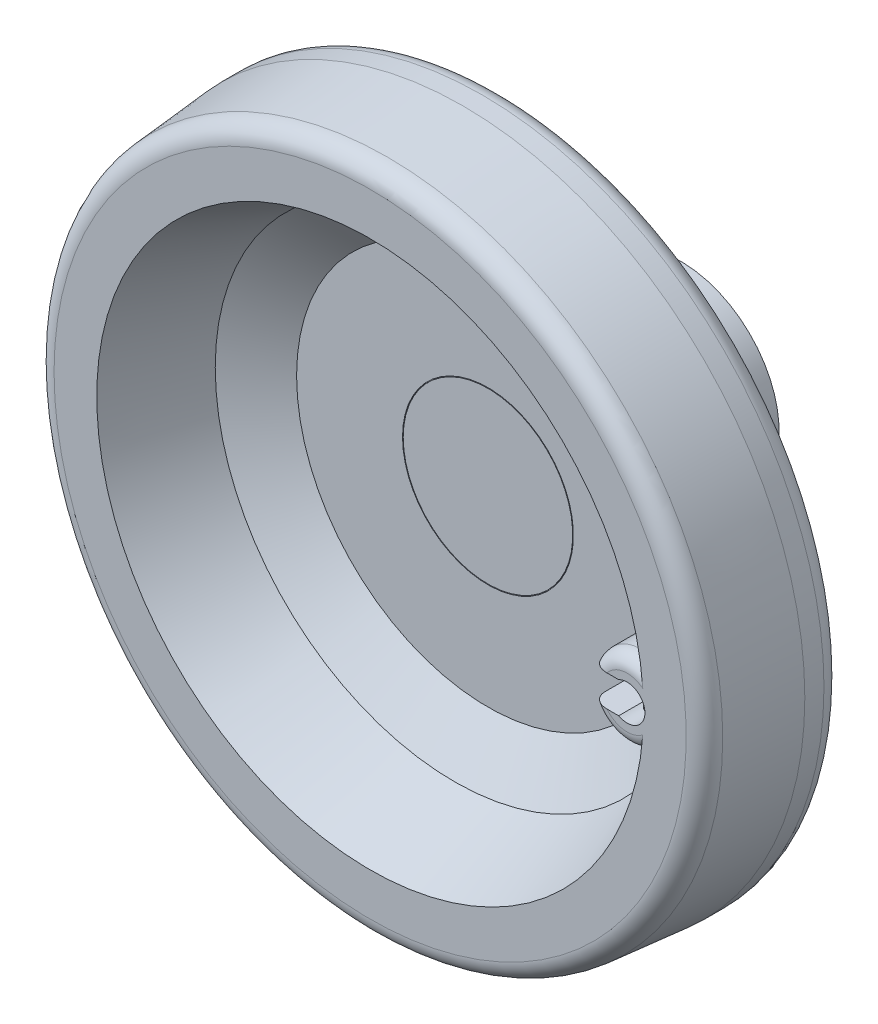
ISO-10303-21;
HEADER;
FILE_DESCRIPTION(('STEP AP214'),'2;1');
FILE_NAME('part.step','',(''),(''),'','','');
FILE_SCHEMA(('AUTOMOTIVE_DESIGN { 1 0 10303 214 1 1 1 1 }'));
ENDSEC;
DATA;
#1=APPLICATION_CONTEXT('core data for automotive mechanical design processes');
#2=APPLICATION_PROTOCOL_DEFINITION('international standard','automotive_design',2000,#1);
#3=PRODUCT_CONTEXT('',#1,'mechanical');
#4=PRODUCT('Part','Part','',(#3));
#5=PRODUCT_RELATED_PRODUCT_CATEGORY('part','',(#4));
#6=PRODUCT_DEFINITION_FORMATION('','',#4);
#7=PRODUCT_DEFINITION_CONTEXT('part definition',#1,'design');
#8=PRODUCT_DEFINITION('design','',#6,#7);
#9=PRODUCT_DEFINITION_SHAPE('','',#8);
#10=(LENGTH_UNIT() NAMED_UNIT(*) SI_UNIT(.MILLI.,.METRE.));
#11=(NAMED_UNIT(*) PLANE_ANGLE_UNIT() SI_UNIT($,.RADIAN.));
#12=(NAMED_UNIT(*) SI_UNIT($,.STERADIAN.) SOLID_ANGLE_UNIT());
#13=UNCERTAINTY_MEASURE_WITH_UNIT(LENGTH_MEASURE(1.E-05),#10,'distance_accuracy_value','');
#14=(GEOMETRIC_REPRESENTATION_CONTEXT(3) GLOBAL_UNCERTAINTY_ASSIGNED_CONTEXT((#13)) GLOBAL_UNIT_ASSIGNED_CONTEXT((#10,
#11,#12)) REPRESENTATION_CONTEXT('',''));
#15=CARTESIAN_POINT('',(0.,0.,0.));
#16=DIRECTION('',(0.,0.,1.));
#17=DIRECTION('',(1.,0.,0.));
#18=AXIS2_PLACEMENT_3D('',#15,#16,#17);
#19=CARTESIAN_POINT('',(47.,0.,48.3333334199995));
#20=DIRECTION('',(0.,0.,1.));
#21=DIRECTION('',(0.,-1.,0.));
#22=AXIS2_PLACEMENT_3D('',#19,#20,#21);
#23=CYLINDRICAL_SURFACE('',#22,3.25);
#24=CARTESIAN_POINT('',(45.7,2.97867420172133,52.1999974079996));
#25=CARTESIAN_POINT('',(45.7000076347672,2.97868123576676,52.1303567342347));
#26=CARTESIAN_POINT('',(45.7056291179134,2.9811509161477,52.0606175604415));
#27=CARTESIAN_POINT('',(45.7279051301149,2.99072094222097,51.9231397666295));
#28=CARTESIAN_POINT('',(45.7445878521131,2.99783312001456,51.8554067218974));
#29=CARTESIAN_POINT('',(45.7882472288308,3.01574296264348,51.724162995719));
#30=CARTESIAN_POINT('',(45.8151851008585,3.02652672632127,51.6606374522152));
#31=CARTESIAN_POINT('',(45.8784768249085,3.05054532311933,51.5390221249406));
#32=CARTESIAN_POINT('',(45.9148286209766,3.06377962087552,51.4809311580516));
#33=CARTESIAN_POINT('',(45.9981407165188,3.09205562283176,51.3684781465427));
#34=CARTESIAN_POINT('',(46.0455534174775,3.10715546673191,51.3144657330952));
#35=CARTESIAN_POINT('',(46.1486890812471,3.13698097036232,51.2149035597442));
#36=CARTESIAN_POINT('',(46.2044149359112,3.15170649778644,51.169356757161));
#37=CARTESIAN_POINT('',(46.3252958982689,3.17982215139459,51.0862832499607));
#38=CARTESIAN_POINT('',(46.3907361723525,3.19313672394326,51.0491436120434));
#39=CARTESIAN_POINT('',(46.5275635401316,3.21622552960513,50.9865490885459));
#40=CARTESIAN_POINT('',(46.5989481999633,3.22600120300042,50.9610894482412));
#41=CARTESIAN_POINT('',(46.7419718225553,3.24049911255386,50.9238254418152));
#42=CARTESIAN_POINT('',(46.8134311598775,3.24544308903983,50.9114196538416));
#43=CARTESIAN_POINT('',(46.957576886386,3.25052201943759,50.8986788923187));
#44=CARTESIAN_POINT('',(47.030262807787,3.25065876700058,50.8983394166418));
#45=CARTESIAN_POINT('',(47.1704511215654,3.24624275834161,50.9094112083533));
#46=CARTESIAN_POINT('',(47.2380153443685,3.24195297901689,50.9201635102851));
#47=CARTESIAN_POINT('',(47.3702875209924,3.22952039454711,50.9519927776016));
#48=CARTESIAN_POINT('',(47.4349952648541,3.22137730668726,50.9730705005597));
#49=CARTESIAN_POINT('',(47.560883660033,3.20187935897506,51.0252111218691));
#50=CARTESIAN_POINT('',(47.6219964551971,3.19047794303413,51.0564197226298));
#51=CARTESIAN_POINT('',(47.7382752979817,3.16559480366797,51.1277996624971));
#52=CARTESIAN_POINT('',(47.793439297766,3.15211236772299,51.167974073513));
#53=CARTESIAN_POINT('',(47.9000997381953,3.1233906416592,51.2592193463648));
#54=CARTESIAN_POINT('',(47.951117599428,3.10809412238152,51.3108324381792));
#55=CARTESIAN_POINT('',(48.0439698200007,3.078150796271,51.4219412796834));
#56=CARTESIAN_POINT('',(48.0858011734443,3.06350420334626,51.4814395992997));
#57=CARTESIAN_POINT('',(48.1601877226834,3.03612983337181,51.6087697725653));
#58=CARTESIAN_POINT('',(48.1924475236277,3.02346794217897,51.6767895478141));
#59=CARTESIAN_POINT('',(48.2448645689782,3.00226933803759,51.8179374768));
#60=CARTESIAN_POINT('',(48.2650296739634,2.99372994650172,51.8910622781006));
#61=CARTESIAN_POINT('',(48.2915207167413,2.9823934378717,52.0355706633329));
#62=CARTESIAN_POINT('',(48.2986168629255,2.97927738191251,52.1067876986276));
#63=CARTESIAN_POINT('',(48.3010148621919,2.97823173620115,52.2494475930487));
#64=CARTESIAN_POINT('',(48.2963202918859,2.98030057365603,52.3208903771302));
#65=CARTESIAN_POINT('',(48.275971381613,2.98906428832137,52.4576957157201));
#66=CARTESIAN_POINT('',(48.2609564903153,2.9954889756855,52.523172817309));
#67=CARTESIAN_POINT('',(48.2212227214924,3.01190533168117,52.6506348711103));
#68=CARTESIAN_POINT('',(48.196501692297,3.02189779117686,52.7126190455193));
#69=CARTESIAN_POINT('',(48.1369381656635,3.04481958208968,52.8341389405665));
#70=CARTESIAN_POINT('',(48.1017258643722,3.05785158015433,52.8934734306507));
#71=CARTESIAN_POINT('',(48.0225573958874,3.0852275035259,53.0056613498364));
#72=CARTESIAN_POINT('',(47.9785976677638,3.09957196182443,53.0585121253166));
#73=CARTESIAN_POINT('',(47.8793487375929,3.1292359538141,53.160290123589));
#74=CARTESIAN_POINT('',(47.8234625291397,3.14454924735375,53.2086391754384));
#75=CARTESIAN_POINT('',(47.70400436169,3.17342866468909,53.295362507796));
#76=CARTESIAN_POINT('',(47.6404320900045,3.18699471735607,53.3337363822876));
#77=CARTESIAN_POINT('',(47.5071819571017,3.21089415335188,53.3992783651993));
#78=CARTESIAN_POINT('',(47.4375055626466,3.22122831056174,53.4264491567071));
#79=CARTESIAN_POINT('',(47.294055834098,3.23747263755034,53.4685041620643));
#80=CARTESIAN_POINT('',(47.2202847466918,3.24338520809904,53.4833950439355));
#81=CARTESIAN_POINT('',(47.0759307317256,3.24986355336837,53.499675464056));
#82=CARTESIAN_POINT('',(47.005453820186,3.25075300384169,53.5018824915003));
#83=CARTESIAN_POINT('',(46.8651680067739,3.24795927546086,53.4948913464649));
#84=CARTESIAN_POINT('',(46.795359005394,3.24427678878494,53.4856949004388));
#85=CARTESIAN_POINT('',(46.6605889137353,3.2329148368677,53.4567419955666));
#86=CARTESIAN_POINT('',(46.595544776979,3.22536162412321,53.4373185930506));
#87=CARTESIAN_POINT('',(46.4696504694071,3.20706716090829,53.3888130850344));
#88=CARTESIAN_POINT('',(46.4088010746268,3.1963253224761,53.3597291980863));
#89=CARTESIAN_POINT('',(46.290068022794,3.17211761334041,53.2912803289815));
#90=CARTESIAN_POINT('',(46.2324342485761,3.15855234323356,53.2515178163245));
#91=CARTESIAN_POINT('',(46.1244148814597,3.13033112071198,53.1634348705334));
#92=CARTESIAN_POINT('',(46.0740323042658,3.1156747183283,53.1151108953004));
#93=CARTESIAN_POINT('',(45.9787191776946,3.08579546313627,53.0077425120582));
#94=CARTESIAN_POINT('',(45.9343192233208,3.07059371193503,52.948219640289));
#95=CARTESIAN_POINT('',(45.8560991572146,3.04232286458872,52.8220850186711));
#96=CARTESIAN_POINT('',(45.8222802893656,3.02925401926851,52.7554724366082));
#97=CARTESIAN_POINT('',(45.7689057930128,3.00793261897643,52.6231232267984));
#98=CARTESIAN_POINT('',(45.7483421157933,2.99935297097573,52.5578450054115));
#99=CARTESIAN_POINT('',(45.7177334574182,2.98639902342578,52.4245818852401));
#100=CARTESIAN_POINT('',(45.7076591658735,2.98201300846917,52.3566050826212));
#101=CARTESIAN_POINT('',(45.7009982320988,2.97910898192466,52.25890199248));
#102=CARTESIAN_POINT('',(45.6999967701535,2.97867122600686,52.2294585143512));
#103=CARTESIAN_POINT('',(45.7,2.97867420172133,52.1999974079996));
#104=B_SPLINE_CURVE_WITH_KNOTS('',3,(#24,#25,#26,#27,#28,#29,#30,#31,#32,#33,#34,#35,#36,#37,
#38,#39,#40,#41,#42,#43,#44,#45,#46,#47,#48,#49,#50,#51,#52,#53,#54,#55,#56,#57,#58,#59,#60,#61,
#62,#63,#64,#65,#66,#67,#68,#69,#70,#71,#72,#73,#74,#75,#76,#77,#78,#79,#80,#81,#82,#83,#84,#85,
#86,#87,#88,#89,#90,#91,#92,#93,#94,#95,#96,#97,#98,#99,#100,#101,#102,#103),.UNSPECIFIED.,.T.,
.F.,(4,2,2,2,2,2,2,2,2,2,2,2,2,2,2,2,2,2,2,2,2,2,2,2,2,2,2,2,2,2,2,2,2,2,2,2,2,2,2,4),(0.,
0.208830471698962,0.418195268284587,0.626776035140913,0.835311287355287,1.05466151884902,
1.27408823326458,1.50216734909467,1.73015353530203,1.94710218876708,2.16396989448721,
2.36865619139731,2.57335750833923,2.78114395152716,2.98900169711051,3.21050628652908,
3.43208324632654,3.65991898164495,3.88760648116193,4.10138395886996,4.31509659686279,
4.51663711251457,4.71822233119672,4.92798250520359,5.137828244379,5.36317427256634,
5.58852947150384,5.81383066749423,6.03900944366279,6.24949675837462,6.45995220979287,
6.66394296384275,6.86797135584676,7.08101583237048,7.29414865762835,7.52047564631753,
7.7468292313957,7.95285829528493,8.1583100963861,8.2466546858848),.UNSPECIFIED.);
#105=CARTESIAN_POINT('',(45.7,2.97867420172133,52.1999974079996));
#106=VERTEX_POINT('',#105);
#107=EDGE_CURVE('E27',#106,#106,#104,.T.);
#108=ORIENTED_EDGE('',*,*,#107,.F.);
#109=EDGE_LOOP('',(#108));
#110=FACE_BOUND('',#109,.T.);
#111=CARTESIAN_POINT('',(47.0000000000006,0.,57.));
#112=DIRECTION('',(0.,0.,1.));
#113=DIRECTION('',(0.,-1.,0.));
#114=AXIS2_PLACEMENT_3D('',#111,#112,#113);
#115=CIRCLE('',#114,3.25);
#116=CARTESIAN_POINT('',(45.4563355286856,-2.86,57.));
#117=VERTEX_POINT('',#116);
#118=CARTESIAN_POINT('',(45.4563355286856,2.86,57.));
#119=VERTEX_POINT('',#118);
#120=EDGE_CURVE('E112',#117,#119,#115,.T.);
#121=ORIENTED_EDGE('',*,*,#120,.T.);
#122=DIRECTION('',(0.,0.,1.));
#123=VECTOR('',#122,1.);
#124=CARTESIAN_POINT('',(45.4563355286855,2.86,48.3333334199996));
#125=LINE('',#124,#123);
#126=CARTESIAN_POINT('',(45.4563355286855,2.86,48.3333334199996));
#127=VERTEX_POINT('',#126);
#128=EDGE_CURVE('E102',#127,#119,#125,.T.);
#129=ORIENTED_EDGE('',*,*,#128,.F.);
#130=CARTESIAN_POINT('',(47.,0.,48.3333334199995));
#131=DIRECTION('',(0.,0.,1.));
#132=DIRECTION('',(0.,-1.,0.));
#133=AXIS2_PLACEMENT_3D('',#130,#131,#132);
#134=CIRCLE('',#133,3.25);
#135=CARTESIAN_POINT('',(45.4563355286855,-2.86,48.3333334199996));
#136=VERTEX_POINT('',#135);
#137=EDGE_CURVE('E89',#136,#127,#134,.T.);
#138=ORIENTED_EDGE('',*,*,#137,.F.);
#139=DIRECTION('',(0.,0.,1.));
#140=VECTOR('',#139,1.);
#141=CARTESIAN_POINT('',(45.4563355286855,-2.86,48.3333334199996));
#142=LINE('',#141,#140);
#143=EDGE_CURVE('E95',#136,#117,#142,.T.);
#144=ORIENTED_EDGE('',*,*,#143,.T.);
#145=EDGE_LOOP('',(#121,#129,#138,#144));
#146=FACE_BOUND('',#145,.T.);
#147=CARTESIAN_POINT('',(45.7,-2.97867420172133,52.1999974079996));
#148=CARTESIAN_POINT('',(45.7000076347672,-2.97868123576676,52.2696380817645));
#149=CARTESIAN_POINT('',(45.7056291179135,-2.98115091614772,52.3393772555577));
#150=CARTESIAN_POINT('',(45.727905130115,-2.99072094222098,52.4768550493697));
#151=CARTESIAN_POINT('',(45.7445878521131,-2.99783312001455,52.5445880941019));
#152=CARTESIAN_POINT('',(45.7882472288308,-3.01574296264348,52.6758318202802));
#153=CARTESIAN_POINT('',(45.8151851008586,-3.0265267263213,52.739357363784));
#154=CARTESIAN_POINT('',(45.8784768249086,-3.05054532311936,52.8609726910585));
#155=CARTESIAN_POINT('',(45.9148286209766,-3.06377962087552,52.9190636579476));
#156=CARTESIAN_POINT('',(45.9981407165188,-3.09205562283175,53.0315166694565));
#157=CARTESIAN_POINT('',(46.0455534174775,-3.10715546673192,53.0855290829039));
#158=CARTESIAN_POINT('',(46.1486890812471,-3.13698097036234,53.1850912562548));
#159=CARTESIAN_POINT('',(46.2044149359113,-3.15170649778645,53.230638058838));
#160=CARTESIAN_POINT('',(46.3252958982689,-3.17982215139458,53.3137115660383));
#161=CARTESIAN_POINT('',(46.3907361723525,-3.19313672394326,53.3508512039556));
#162=CARTESIAN_POINT('',(46.5275635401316,-3.21622552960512,53.4134457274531));
#163=CARTESIAN_POINT('',(46.5989481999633,-3.22600120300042,53.4389053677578));
#164=CARTESIAN_POINT('',(46.7419718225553,-3.24049911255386,53.4761693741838));
#165=CARTESIAN_POINT('',(46.8134311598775,-3.24544308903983,53.4885751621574));
#166=CARTESIAN_POINT('',(46.957576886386,-3.25052201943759,53.5013159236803));
#167=CARTESIAN_POINT('',(47.030262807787,-3.25065876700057,53.5016553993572));
#168=CARTESIAN_POINT('',(47.1704511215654,-3.24624275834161,53.4905836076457));
#169=CARTESIAN_POINT('',(47.2380153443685,-3.24195297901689,53.4798313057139));
#170=CARTESIAN_POINT('',(47.3702875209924,-3.22952039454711,53.4480020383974));
#171=CARTESIAN_POINT('',(47.4349952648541,-3.22137730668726,53.4269243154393));
#172=CARTESIAN_POINT('',(47.560883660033,-3.20187935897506,53.3747836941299));
#173=CARTESIAN_POINT('',(47.6219964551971,-3.19047794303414,53.3435750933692));
#174=CARTESIAN_POINT('',(47.7382752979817,-3.16559480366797,53.2721951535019));
#175=CARTESIAN_POINT('',(47.793439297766,-3.15211236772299,53.232020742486));
#176=CARTESIAN_POINT('',(47.9000997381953,-3.1233906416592,53.1407754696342));
#177=CARTESIAN_POINT('',(47.951117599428,-3.10809412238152,53.0891623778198));
#178=CARTESIAN_POINT('',(48.0439698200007,-3.07815079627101,52.9780535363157));
#179=CARTESIAN_POINT('',(48.0858011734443,-3.06350420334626,52.9185552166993));
#180=CARTESIAN_POINT('',(48.1601877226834,-3.03612983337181,52.7912250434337));
#181=CARTESIAN_POINT('',(48.1924475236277,-3.02346794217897,52.7232052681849));
#182=CARTESIAN_POINT('',(48.2448645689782,-3.00226933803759,52.582057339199));
#183=CARTESIAN_POINT('',(48.2650296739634,-2.99372994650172,52.5089325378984));
#184=CARTESIAN_POINT('',(48.2915207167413,-2.9823934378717,52.3644241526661));
#185=CARTESIAN_POINT('',(48.2986168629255,-2.97927738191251,52.2932071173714));
#186=CARTESIAN_POINT('',(48.3010148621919,-2.97823173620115,52.1505472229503));
#187=CARTESIAN_POINT('',(48.2963202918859,-2.98030057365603,52.0791044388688));
#188=CARTESIAN_POINT('',(48.275971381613,-2.98906428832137,51.9422991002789));
#189=CARTESIAN_POINT('',(48.2609564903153,-2.99548897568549,51.87682199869));
#190=CARTESIAN_POINT('',(48.2212227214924,-3.01190533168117,51.7493599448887));
#191=CARTESIAN_POINT('',(48.196501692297,-3.02189779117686,51.6873757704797));
#192=CARTESIAN_POINT('',(48.1369381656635,-3.04481958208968,51.5658558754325));
#193=CARTESIAN_POINT('',(48.1017258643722,-3.05785158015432,51.5065213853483));
#194=CARTESIAN_POINT('',(48.0225573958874,-3.0852275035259,51.3943334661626));
#195=CARTESIAN_POINT('',(47.9785976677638,-3.09957196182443,51.3414826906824));
#196=CARTESIAN_POINT('',(47.8793487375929,-3.1292359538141,51.23970469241));
#197=CARTESIAN_POINT('',(47.8234625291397,-3.14454924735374,51.1913556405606));
#198=CARTESIAN_POINT('',(47.70400436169,-3.17342866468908,51.104632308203));
#199=CARTESIAN_POINT('',(47.6404320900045,-3.18699471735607,51.0662584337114));
#200=CARTESIAN_POINT('',(47.5071819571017,-3.21089415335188,51.0007164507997));
#201=CARTESIAN_POINT('',(47.4375055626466,-3.22122831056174,50.9735456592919));
#202=CARTESIAN_POINT('',(47.294055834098,-3.23747263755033,50.9314906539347));
#203=CARTESIAN_POINT('',(47.2202847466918,-3.24338520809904,50.9165997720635));
#204=CARTESIAN_POINT('',(47.0759307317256,-3.24986355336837,50.900319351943));
#205=CARTESIAN_POINT('',(47.005453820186,-3.25075300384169,50.8981123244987));
#206=CARTESIAN_POINT('',(46.8651680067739,-3.24795927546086,50.9051034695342));
#207=CARTESIAN_POINT('',(46.795359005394,-3.24427678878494,50.9142999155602));
#208=CARTESIAN_POINT('',(46.6605889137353,-3.2329148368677,50.9432528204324));
#209=CARTESIAN_POINT('',(46.595544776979,-3.22536162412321,50.9626762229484));
#210=CARTESIAN_POINT('',(46.4696504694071,-3.2070671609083,51.0111817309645));
#211=CARTESIAN_POINT('',(46.4088010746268,-3.1963253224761,51.0402656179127));
#212=CARTESIAN_POINT('',(46.290068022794,-3.17211761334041,51.1087144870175));
#213=CARTESIAN_POINT('',(46.2324342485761,-3.15855234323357,51.1484769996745));
#214=CARTESIAN_POINT('',(46.1244148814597,-3.13033112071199,51.2365599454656));
#215=CARTESIAN_POINT('',(46.0740323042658,-3.1156747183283,51.2848839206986));
#216=CARTESIAN_POINT('',(45.9787191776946,-3.08579546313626,51.3922523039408));
#217=CARTESIAN_POINT('',(45.9343192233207,-3.07059371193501,51.45177517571));
#218=CARTESIAN_POINT('',(45.8560991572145,-3.04232286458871,51.577909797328));
#219=CARTESIAN_POINT('',(45.8222802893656,-3.02925401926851,51.644522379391));
#220=CARTESIAN_POINT('',(45.7689057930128,-3.00793261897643,51.7768715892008));
#221=CARTESIAN_POINT('',(45.7483421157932,-2.99935297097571,51.8421498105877));
#222=CARTESIAN_POINT('',(45.7177334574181,-2.98639902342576,51.9754129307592));
#223=CARTESIAN_POINT('',(45.7076591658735,-2.98201300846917,52.0433897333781));
#224=CARTESIAN_POINT('',(45.7009982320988,-2.97910898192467,52.1410928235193));
#225=CARTESIAN_POINT('',(45.6999967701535,-2.97867122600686,52.1705363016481));
#226=CARTESIAN_POINT('',(45.7,-2.97867420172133,52.1999974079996));
#227=B_SPLINE_CURVE_WITH_KNOTS('',3,(#147,#148,#149,#150,#151,#152,#153,#154,#155,#156,#157,
#158,#159,#160,#161,#162,#163,#164,#165,#166,#167,#168,#169,#170,#171,#172,#173,#174,#175,#176,
#177,#178,#179,#180,#181,#182,#183,#184,#185,#186,#187,#188,#189,#190,#191,#192,#193,#194,#195,
#196,#197,#198,#199,#200,#201,#202,#203,#204,#205,#206,#207,#208,#209,#210,#211,#212,#213,#214,
#215,#216,#217,#218,#219,#220,#221,#222,#223,#224,#225,#226),.UNSPECIFIED.,.T.,.F.,(4,2,2,2,2,2,
2,2,2,2,2,2,2,2,2,2,2,2,2,2,2,2,2,2,2,2,2,2,2,2,2,2,2,2,2,2,2,2,2,4),(0.,0.208830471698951,
0.418195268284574,0.626776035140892,0.835311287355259,1.0546615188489,1.27408823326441,
1.5021673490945,1.73015353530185,1.9471021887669,2.16396989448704,2.36865619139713,
2.57335750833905,2.78114395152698,2.98900169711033,3.21050628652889,3.43208324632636,
3.65991898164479,3.88760648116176,4.10138395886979,4.31509659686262,4.5166371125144,
4.71822233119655,4.92798250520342,5.13782824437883,5.36317427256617,5.58852947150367,
5.81383066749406,6.03900944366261,6.24949675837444,6.4599522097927,6.66394296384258,
6.86797135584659,7.0810158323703,7.29414865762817,7.52047564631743,7.74682923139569,
7.95285829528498,8.15831009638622,8.24665468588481),.UNSPECIFIED.);
#228=CARTESIAN_POINT('',(45.7,-2.97867420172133,52.1999974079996));
#229=VERTEX_POINT('',#228);
#230=EDGE_CURVE('E9',#229,#229,#227,.T.);
#231=ORIENTED_EDGE('',*,*,#230,.F.);
#232=EDGE_LOOP('',(#231));
#233=FACE_BOUND('',#232,.T.);
#234=ADVANCED_FACE('F14',(#110,#146,#233),#23,.F.);
#235=CARTESIAN_POINT('',(47.,0.,54.46));
#236=DIRECTION('',(0.,0.,-1.));
#237=DIRECTION('',(0.,1.,0.));
#238=AXIS2_PLACEMENT_3D('',#235,#236,#237);
#239=TOROIDAL_SURFACE('',#238,4.66000000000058,2.53999999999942);
#240=CARTESIAN_POINT('',(47.,0.,54.46));
#241=DIRECTION('',(0.,0.,-1.));
#242=DIRECTION('',(0.,1.,0.));
#243=AXIS2_PLACEMENT_3D('',#240,#241,#242);
#244=CIRCLE('',#243,7.2);
#245=CARTESIAN_POINT('',(40.3923983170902,2.86,54.46));
#246=VERTEX_POINT('',#245);
#247=CARTESIAN_POINT('',(48.4605317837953,7.05030828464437,54.4599999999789));
#248=VERTEX_POINT('',#247);
#249=EDGE_CURVE('E123',#246,#248,#244,.T.);
#250=ORIENTED_EDGE('',*,*,#249,.F.);
#251=CARTESIAN_POINT('',(42.2101940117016,2.86,56.8280369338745));
#252=CARTESIAN_POINT('',(42.3128628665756,2.86,56.8622344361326));
#253=CARTESIAN_POINT('',(42.4173424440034,2.86,56.8910755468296));
#254=CARTESIAN_POINT('',(42.6286692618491,2.86,56.9384222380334));
#255=CARTESIAN_POINT('',(42.7355184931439,2.86,56.9569187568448));
#256=CARTESIAN_POINT('',(42.9506042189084,2.86,56.9841511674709));
#257=CARTESIAN_POINT('',(43.0588426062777,2.86,56.9928718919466));
#258=CARTESIAN_POINT('',(43.2756789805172,2.86,57.0012450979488));
#259=CARTESIAN_POINT('',(43.3842770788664,2.86,57.0008944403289));
#260=CARTESIAN_POINT('',(43.6233735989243,2.86,56.9910713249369));
#261=CARTESIAN_POINT('',(43.7537935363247,2.86,56.9797419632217));
#262=CARTESIAN_POINT('',(44.0133410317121,2.86,56.9468869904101));
#263=CARTESIAN_POINT('',(44.1424680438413,2.86,56.9253572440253));
#264=CARTESIAN_POINT('',(44.4001205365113,2.86,56.8738281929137));
#265=CARTESIAN_POINT('',(44.5286315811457,2.86,56.8437584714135));
#266=CARTESIAN_POINT('',(44.7839632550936,2.86,56.7775023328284));
#267=CARTESIAN_POINT('',(44.9107846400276,2.86,56.7413187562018));
#268=CARTESIAN_POINT('',(45.1865509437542,2.86,56.6584388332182));
#269=CARTESIAN_POINT('',(45.3352760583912,2.86,56.6110328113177));
#270=CARTESIAN_POINT('',(45.5586295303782,2.86,56.5402981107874));
#271=CARTESIAN_POINT('',(45.633191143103,2.86,56.5167615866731));
#272=CARTESIAN_POINT('',(45.7826311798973,2.86,56.4707240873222));
#273=CARTESIAN_POINT('',(45.8575096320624,2.86,56.4482232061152));
#274=CARTESIAN_POINT('',(46.0792765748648,2.86,56.3848529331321));
#275=CARTESIAN_POINT('',(46.2270684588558,2.86,56.3468156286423));
#276=CARTESIAN_POINT('',(46.4510240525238,2.86,56.3023191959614));
#277=CARTESIAN_POINT('',(46.5259086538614,2.86,56.2895927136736));
#278=CARTESIAN_POINT('',(46.6763846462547,2.86,56.2693492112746));
#279=CARTESIAN_POINT('',(46.7519759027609,2.86,56.2618312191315));
#280=CARTESIAN_POINT('',(46.9061632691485,2.86,56.2525783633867));
#281=CARTESIAN_POINT('',(46.9847724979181,2.86,56.2510535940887));
#282=CARTESIAN_POINT('',(47.1418455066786,2.86,56.2545407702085));
#283=CARTESIAN_POINT('',(47.2203092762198,2.86,56.2595531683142));
#284=CARTESIAN_POINT('',(47.3768640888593,2.86,56.275591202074));
#285=CARTESIAN_POINT('',(47.4549530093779,2.86,56.2866368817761));
#286=CARTESIAN_POINT('',(47.6102732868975,2.86,56.3136882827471));
#287=CARTESIAN_POINT('',(47.6875042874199,2.86,56.3296959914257));
#288=CARTESIAN_POINT('',(47.8431858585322,2.86,56.3658857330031));
#289=CARTESIAN_POINT('',(47.9216121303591,2.86,56.3861698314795));
#290=CARTESIAN_POINT('',(48.0777426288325,2.86,56.4292908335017));
#291=CARTESIAN_POINT('',(48.1554468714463,2.86,56.4521276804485));
#292=CARTESIAN_POINT('',(48.3103755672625,2.86,56.4991556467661));
#293=CARTESIAN_POINT('',(48.3876003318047,2.86,56.5233457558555));
#294=CARTESIAN_POINT('',(48.5419303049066,2.86,56.5721002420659));
#295=CARTESIAN_POINT('',(48.6190355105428,2.86,56.5966646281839));
#296=CARTESIAN_POINT('',(48.8536326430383,2.86,56.6705674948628));
#297=CARTESIAN_POINT('',(49.0113854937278,2.86,56.7191205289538));
#298=CARTESIAN_POINT('',(49.3292045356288,2.86,56.8083520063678));
#299=CARTESIAN_POINT('',(49.4892709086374,2.86,56.8490298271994));
#300=CARTESIAN_POINT('',(49.8095947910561,2.86,56.9173598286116));
#301=CARTESIAN_POINT('',(49.969808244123,2.86,56.9452100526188));
#302=CARTESIAN_POINT('',(50.2921220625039,2.86,56.9850551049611));
#303=CARTESIAN_POINT('',(50.4542205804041,2.86,56.9970643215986));
#304=CARTESIAN_POINT('',(50.7982121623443,2.86,57.0022734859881));
#305=CARTESIAN_POINT('',(50.9801726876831,2.86,56.9930736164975));
#306=CARTESIAN_POINT('',(51.2508020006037,2.86,56.9585690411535));
#307=CARTESIAN_POINT('',(51.3408482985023,2.86,56.9435531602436));
#308=CARTESIAN_POINT('',(51.5194043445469,2.86,56.906235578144));
#309=CARTESIAN_POINT('',(51.6079147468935,2.86,56.883937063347));
#310=CARTESIAN_POINT('',(51.7833827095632,2.86,56.8315806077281));
#311=CARTESIAN_POINT('',(51.8703224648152,2.86,56.8014627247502));
#312=CARTESIAN_POINT('',(52.0410528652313,2.86,56.7334191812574));
#313=CARTESIAN_POINT('',(52.1248450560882,2.86,56.6954974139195));
#314=CARTESIAN_POINT('',(52.2883341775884,2.86,56.6118543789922));
#315=CARTESIAN_POINT('',(52.3680360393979,2.86,56.5661428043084));
#316=CARTESIAN_POINT('',(52.5224759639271,2.86,56.4670469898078));
#317=CARTESIAN_POINT('',(52.597214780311,2.86,56.4136639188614));
#318=CARTESIAN_POINT('',(52.7967530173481,2.86,56.2549207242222));
#319=CARTESIAN_POINT('',(52.9152689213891,2.86,56.1414308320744));
#320=CARTESIAN_POINT('',(53.1281373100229,2.86,55.8937408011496));
#321=CARTESIAN_POINT('',(53.2225029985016,2.86,55.7595520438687));
#322=CARTESIAN_POINT('',(53.3724913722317,2.86,55.4927211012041));
#323=CARTESIAN_POINT('',(53.4314730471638,2.86,55.3619625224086));
#324=CARTESIAN_POINT('',(53.5249357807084,2.86,55.0919851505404));
#325=CARTESIAN_POINT('',(53.5594302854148,2.86,54.9527710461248));
#326=CARTESIAN_POINT('',(53.6010956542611,2.86,54.679417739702));
#327=CARTESIAN_POINT('',(53.6098673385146,2.86,54.5455203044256));
#328=CARTESIAN_POINT('',(53.604342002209,2.86,54.2782120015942));
#329=CARTESIAN_POINT('',(53.590048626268,2.86,54.1448010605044));
#330=CARTESIAN_POINT('',(53.539421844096,2.86,53.8848118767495));
#331=CARTESIAN_POINT('',(53.5035003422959,2.86,53.7581529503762));
#332=CARTESIAN_POINT('',(53.4112778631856,2.86,53.5125066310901));
#333=CARTESIAN_POINT('',(53.3549764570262,2.86,53.393519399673));
#334=CARTESIAN_POINT('',(53.2227247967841,2.86,53.1640745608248));
#335=CARTESIAN_POINT('',(53.1464279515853,2.86,53.0538172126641));
#336=CARTESIAN_POINT('',(52.9772992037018,2.86,52.8468465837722));
#337=CARTESIAN_POINT('',(52.884464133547,2.86,52.750135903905));
#338=CARTESIAN_POINT('',(52.6796431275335,2.86,52.567117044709));
#339=CARTESIAN_POINT('',(52.5668832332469,2.86,52.4816770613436));
#340=CARTESIAN_POINT('',(52.3296953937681,2.86,52.3290316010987));
#341=CARTESIAN_POINT('',(52.2052654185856,2.86,52.2618293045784));
#342=CARTESIAN_POINT('',(51.9356193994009,2.86,52.1403253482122));
#343=CARTESIAN_POINT('',(51.7895580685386,2.86,52.087908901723));
#344=CARTESIAN_POINT('',(51.4913447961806,2.86,52.0047022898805));
#345=CARTESIAN_POINT('',(51.3391870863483,2.86,51.9739331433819));
#346=CARTESIAN_POINT('',(51.0708454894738,2.86,51.9377288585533));
#347=CARTESIAN_POINT('',(50.9552197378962,2.86,51.9278730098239));
#348=CARTESIAN_POINT('',(50.72351380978,2.86,51.9185330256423));
#349=CARTESIAN_POINT('',(50.6074334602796,2.86,51.9190533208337));
#350=CARTESIAN_POINT('',(50.3758354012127,2.86,51.9294107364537));
#351=CARTESIAN_POINT('',(50.2603172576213,2.86,51.9392388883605));
#352=CARTESIAN_POINT('',(50.0302511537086,2.86,51.9669981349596));
#353=CARTESIAN_POINT('',(49.9157034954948,2.86,51.984931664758));
#354=CARTESIAN_POINT('',(49.6838046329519,2.86,52.0283372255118));
#355=CARTESIAN_POINT('',(49.566500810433,2.86,52.0540572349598));
#356=CARTESIAN_POINT('',(49.3332909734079,2.86,52.1111190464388));
#357=CARTESIAN_POINT('',(49.2173850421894,2.86,52.1424611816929));
#358=CARTESIAN_POINT('',(48.9858525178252,2.86,52.2091289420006));
#359=CARTESIAN_POINT('',(48.8702338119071,2.86,52.2444813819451));
#360=CARTESIAN_POINT('',(48.6394776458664,2.86,52.3167215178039));
#361=CARTESIAN_POINT('',(48.5243402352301,2.86,52.353609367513));
#362=CARTESIAN_POINT('',(48.2923160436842,2.86,52.4265106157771));
#363=CARTESIAN_POINT('',(48.1754243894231,2.86,52.4625090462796));
#364=CARTESIAN_POINT('',(47.9401105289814,2.86,52.5294517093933));
#365=CARTESIAN_POINT('',(47.8216879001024,2.86,52.5603945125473));
#366=CARTESIAN_POINT('',(47.5846404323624,2.86,52.6120917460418));
#367=CARTESIAN_POINT('',(47.4660551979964,2.86,52.6330145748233));
#368=CARTESIAN_POINT('',(47.28705777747,2.86,52.6541673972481));
#369=CARTESIAN_POINT('',(47.2272475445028,2.86,52.6595129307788));
#370=CARTESIAN_POINT('',(47.1074066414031,2.86,52.6665018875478));
#371=CARTESIAN_POINT('',(47.0473759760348,2.86,52.6681453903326));
#372=CARTESIAN_POINT('',(46.9211819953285,2.86,52.6675835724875));
#373=CARTESIAN_POINT('',(46.8550202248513,2.86,52.6649668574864));
#374=CARTESIAN_POINT('',(46.7230244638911,2.86,52.6553021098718));
#375=CARTESIAN_POINT('',(46.6571905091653,2.86,52.6482536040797));
#376=CARTESIAN_POINT('',(46.4602714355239,2.86,52.6211639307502));
#377=CARTESIAN_POINT('',(46.3300115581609,2.86,52.5951827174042));
#378=CARTESIAN_POINT('',(46.0692467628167,2.86,52.5326695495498));
#379=CARTESIAN_POINT('',(45.9387988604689,2.86,52.4959191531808));
#380=CARTESIAN_POINT('',(45.6793177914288,2.86,52.4181220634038));
#381=CARTESIAN_POINT('',(45.5502839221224,2.86,52.3770776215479));
#382=CARTESIAN_POINT('',(45.2630367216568,2.86,52.2860276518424));
#383=CARTESIAN_POINT('',(45.1048011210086,2.86,52.2360872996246));
#384=CARTESIAN_POINT('',(44.7862798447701,2.86,52.1428831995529));
#385=CARTESIAN_POINT('',(44.6259940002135,2.86,52.0996200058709));
#386=CARTESIAN_POINT('',(44.3047609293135,2.86,52.0251619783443));
#387=CARTESIAN_POINT('',(44.1438504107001,2.86,51.9938152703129));
#388=CARTESIAN_POINT('',(43.8198566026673,2.86,51.9463946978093));
#389=CARTESIAN_POINT('',(43.6567752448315,2.86,51.9303080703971));
#390=CARTESIAN_POINT('',(43.307752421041,2.86,51.9159535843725));
#391=CARTESIAN_POINT('',(43.1216648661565,2.86,51.9203504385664));
#392=CARTESIAN_POINT('',(42.8443690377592,2.86,51.9480902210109));
#393=CARTESIAN_POINT('',(42.7520449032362,2.86,51.960911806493));
#394=CARTESIAN_POINT('',(42.5687632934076,2.86,51.9940371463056));
#395=CARTESIAN_POINT('',(42.4778052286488,2.86,52.0143375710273));
#396=CARTESIAN_POINT('',(42.2971919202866,2.86,52.062949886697));
#397=CARTESIAN_POINT('',(42.2075550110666,2.86,52.0913302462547));
#398=CARTESIAN_POINT('',(42.0313063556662,2.86,52.1562144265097));
#399=CARTESIAN_POINT('',(41.9446931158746,2.86,52.1927141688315));
#400=CARTESIAN_POINT('',(41.7754761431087,2.86,52.2738684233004));
#401=CARTESIAN_POINT('',(41.6928682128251,2.86,52.3185141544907));
#402=CARTESIAN_POINT('',(41.5325653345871,2.86,52.4158967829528));
#403=CARTESIAN_POINT('',(41.4548695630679,2.86,52.4686323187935));
#404=CARTESIAN_POINT('',(41.3142663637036,2.86,52.5752241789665));
#405=CARTESIAN_POINT('',(41.250697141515,2.86,52.6282086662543));
#406=CARTESIAN_POINT('',(41.1288790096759,2.86,52.7399693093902));
#407=CARTESIAN_POINT('',(41.0706292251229,2.86,52.7987445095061));
#408=CARTESIAN_POINT('',(40.9601498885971,2.86,52.9216772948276));
#409=CARTESIAN_POINT('',(40.9079179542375,2.86,52.9858327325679));
#410=CARTESIAN_POINT('',(40.8101154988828,2.86,53.118998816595));
#411=CARTESIAN_POINT('',(40.7645441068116,2.86,53.1880088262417));
#412=CARTESIAN_POINT('',(40.6496524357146,2.86,53.38292249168));
#413=CARTESIAN_POINT('',(40.5876157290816,2.86,53.5132380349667));
#414=CARTESIAN_POINT('',(40.4881474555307,2.86,53.7828355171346));
#415=CARTESIAN_POINT('',(40.4507020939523,2.86,53.9221123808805));
#416=CARTESIAN_POINT('',(40.4035660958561,2.86,54.1956922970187));
#417=CARTESIAN_POINT('',(40.3921875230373,2.86,54.329705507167));
#418=CARTESIAN_POINT('',(40.3926149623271,2.86,54.597681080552));
#419=CARTESIAN_POINT('',(40.4044170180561,2.86,54.7316434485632));
#420=CARTESIAN_POINT('',(40.45025851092,2.86,54.9928317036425));
#421=CARTESIAN_POINT('',(40.4838337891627,2.86,55.1201395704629));
#422=CARTESIAN_POINT('',(40.571543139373,2.86,55.3674385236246));
#423=CARTESIAN_POINT('',(40.6256766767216,2.86,55.4874298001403));
#424=CARTESIAN_POINT('',(40.753664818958,2.86,55.7189670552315));
#425=CARTESIAN_POINT('',(40.8278311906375,2.86,55.8303402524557));
#426=CARTESIAN_POINT('',(40.992958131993,2.86,56.0398638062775));
#427=CARTESIAN_POINT('',(41.0839256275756,2.86,56.1380086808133));
#428=CARTESIAN_POINT('',(41.2850231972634,2.86,56.3240430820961));
#429=CARTESIAN_POINT('',(41.3959183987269,2.86,56.4111023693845));
#430=CARTESIAN_POINT('',(41.6296136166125,2.86,56.5671295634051));
#431=CARTESIAN_POINT('',(41.7524024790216,2.86,56.6361142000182));
#432=CARTESIAN_POINT('',(41.933149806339,2.86,56.721181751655));
#433=CARTESIAN_POINT('',(41.9876743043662,2.86,56.7448354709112));
#434=CARTESIAN_POINT('',(42.0980155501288,2.86,56.7888759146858));
#435=CARTESIAN_POINT('',(42.1538319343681,2.86,56.8092635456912));
#436=CARTESIAN_POINT('',(42.2101940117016,2.86,56.8280369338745));
#437=B_SPLINE_CURVE_WITH_KNOTS('',3,(#251,#252,#253,#254,#255,#256,#257,#258,#259,#260,#261,
#262,#263,#264,#265,#266,#267,#268,#269,#270,#271,#272,#273,#274,#275,#276,#277,#278,#279,#280,
#281,#282,#283,#284,#285,#286,#287,#288,#289,#290,#291,#292,#293,#294,#295,#296,#297,#298,#299,
#300,#301,#302,#303,#304,#305,#306,#307,#308,#309,#310,#311,#312,#313,#314,#315,#316,#317,#318,
#319,#320,#321,#322,#323,#324,#325,#326,#327,#328,#329,#330,#331,#332,#333,#334,#335,#336,#337,
#338,#339,#340,#341,#342,#343,#344,#345,#346,#347,#348,#349,#350,#351,#352,#353,#354,#355,#356,
#357,#358,#359,#360,#361,#362,#363,#364,#365,#366,#367,#368,#369,#370,#371,#372,#373,#374,#375,
#376,#377,#378,#379,#380,#381,#382,#383,#384,#385,#386,#387,#388,#389,#390,#391,#392,#393,#394,
#395,#396,#397,#398,#399,#400,#401,#402,#403,#404,#405,#406,#407,#408,#409,#410,#411,#412,#413,
#414,#415,#416,#417,#418,#419,#420,#421,#422,#423,#424,#425,#426,#427,#428,#429,#430,#431,#432,
#433,#434,#435,#436),.UNSPECIFIED.,.T.,.F.,(4,2,2,2,2,2,2,2,2,2,2,2,2,2,2,2,2,2,2,2,2,2,2,2,2,2,
2,2,2,2,2,2,2,2,2,2,2,2,2,2,2,2,2,2,2,2,2,2,2,2,2,2,2,2,2,2,2,2,2,2,2,2,2,2,2,2,2,2,2,2,2,2,2,2,
2,2,2,2,2,2,2,2,2,2,2,2,2,2,2,2,2,2,4),(0.,0.324560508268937,0.649404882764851,
0.974752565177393,1.30021283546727,1.69245304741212,2.08485241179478,2.48058625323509,
2.87613674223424,3.3444180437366,3.5789745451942,3.81355230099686,4.27073940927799,
4.49846442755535,4.7261469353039,4.9617432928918,5.19735596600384,5.43375620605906,
5.67025125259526,5.91320525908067,6.15615387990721,6.39892348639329,6.6416989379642,
7.13679162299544,7.63192342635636,8.11913114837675,8.60589603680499,9.15039386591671,
9.42401170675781,9.69750999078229,9.97317017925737,10.2486931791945,10.5238758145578,
10.7990165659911,11.2881854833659,11.7770863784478,12.2051775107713,12.6330333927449,
13.0336297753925,13.43416286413,13.8272990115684,14.2204434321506,14.6209137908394,
15.0214609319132,15.4441049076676,15.8668225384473,16.3305689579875,16.7947650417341,
17.1424309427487,17.4902453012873,17.8377248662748,18.1853088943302,18.5453967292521,
18.9055059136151,19.268183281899,19.6308970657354,19.997789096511,20.3647846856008,
20.725374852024,20.9054185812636,21.0854584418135,21.2839361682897,21.4824350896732,
21.8801549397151,22.2865781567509,22.6927893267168,23.1905492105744,23.6883503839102,
24.1795755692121,24.6703895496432,25.2267096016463,25.5060833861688,25.785332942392,
26.0670231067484,26.3485720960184,26.6298193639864,26.9110193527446,27.1589281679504,
27.4067961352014,27.6545656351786,27.9023027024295,28.3328131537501,28.7630819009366,
29.1645895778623,29.5660287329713,29.9591795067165,30.3523200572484,30.7519716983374,
31.1517884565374,31.5730081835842,31.9938366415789,32.1720600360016,32.3502338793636),.UNSPECIFIED.);
#438=CARTESIAN_POINT('',(43.3208696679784,2.86,57.));
#439=VERTEX_POINT('',#438);
#440=EDGE_CURVE('E168',#246,#439,#437,.T.);
#441=ORIENTED_EDGE('',*,*,#440,.T.);
#442=CARTESIAN_POINT('',(47.0000000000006,0.,57.));
#443=DIRECTION('',(0.,0.,-1.));
#444=DIRECTION('',(0.,1.,0.));
#445=AXIS2_PLACEMENT_3D('',#442,#443,#444);
#446=CIRCLE('',#445,4.66);
#447=CARTESIAN_POINT('',(49.8647276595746,3.67545037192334,57.));
#448=VERTEX_POINT('',#447);
#449=EDGE_CURVE('E119',#439,#448,#446,.T.);
#450=ORIENTED_EDGE('',*,*,#449,.T.);
#451=CARTESIAN_POINT('',(48.4604473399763,-7.0503257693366,54.4598));
#452=CARTESIAN_POINT('',(48.4916738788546,-7.0438708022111,54.5337651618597));
#453=CARTESIAN_POINT('',(48.523228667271,-7.03381758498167,54.6072560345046));
#454=CARTESIAN_POINT('',(48.5867075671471,-7.00679603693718,54.7527478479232));
#455=CARTESIAN_POINT('',(48.618631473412,-6.9898313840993,54.8247495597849));
#456=CARTESIAN_POINT('',(48.6824685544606,-6.94934123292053,54.9665201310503));
#457=CARTESIAN_POINT('',(48.7143812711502,-6.92584198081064,55.0362967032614));
#458=CARTESIAN_POINT('',(48.7780612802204,-6.87258421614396,55.1734723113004));
#459=CARTESIAN_POINT('',(48.8098285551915,-6.84282497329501,55.2408710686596));
#460=CARTESIAN_POINT('',(48.904421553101,-6.74477527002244,55.438648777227));
#461=CARTESIAN_POINT('',(48.9667134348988,-6.66760002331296,55.5649962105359));
#462=CARTESIAN_POINT('',(49.0880056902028,-6.49252664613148,55.804182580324));
#463=CARTESIAN_POINT('',(49.1470029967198,-6.39460960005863,55.9170090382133));
#464=CARTESIAN_POINT('',(49.2646785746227,-6.17266703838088,56.1356313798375));
#465=CARTESIAN_POINT('',(49.3229628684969,-6.04718942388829,56.240166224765));
#466=CARTESIAN_POINT('',(49.4323982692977,-5.77957985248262,56.4297793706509));
#467=CARTESIAN_POINT('',(49.4835471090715,-5.63744262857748,56.5148514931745));
#468=CARTESIAN_POINT('',(49.5819649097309,-5.32632919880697,56.6716816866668));
#469=CARTESIAN_POINT('',(49.6284180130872,-5.15608606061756,56.7414382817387));
#470=CARTESIAN_POINT('',(49.7103357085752,-4.80501324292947,56.8561387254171));
#471=CARTESIAN_POINT('',(49.7457992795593,-4.62418258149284,56.9010802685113));
#472=CARTESIAN_POINT('',(49.807946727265,-4.23928711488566,56.9694438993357));
#473=CARTESIAN_POINT('',(49.8335129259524,-4.03462179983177,56.990486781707));
#474=CARTESIAN_POINT('',(49.8707747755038,-3.62290845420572,57.0043649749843));
#475=CARTESIAN_POINT('',(49.8824555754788,-3.41585811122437,56.9971701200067));
#476=CARTESIAN_POINT('',(49.8901855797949,-3.09637586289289,56.9655744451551));
#477=CARTESIAN_POINT('',(49.8908890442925,-2.98303514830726,56.9503062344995));
#478=CARTESIAN_POINT('',(49.8883666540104,-2.75769105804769,56.9121522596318));
#479=CARTESIAN_POINT('',(49.8851414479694,-2.64568746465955,56.8892677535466));
#480=CARTESIAN_POINT('',(49.8749691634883,-2.42375872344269,56.8364043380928));
#481=CARTESIAN_POINT('',(49.8680284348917,-2.31383035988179,56.8064375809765));
#482=CARTESIAN_POINT('',(49.8506787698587,-2.09625879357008,56.7399439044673));
#483=CARTESIAN_POINT('',(49.8402696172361,-1.98861573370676,56.7034165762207));
#484=CARTESIAN_POINT('',(49.8157202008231,-1.77088983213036,56.6225972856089));
#485=CARTESIAN_POINT('',(49.8014274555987,-1.66093041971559,56.5780208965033));
#486=CARTESIAN_POINT('',(49.7698122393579,-1.44390288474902,56.4833498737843));
#487=CARTESIAN_POINT('',(49.7524902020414,-1.33683435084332,56.4332560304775));
#488=CARTESIAN_POINT('',(49.7153758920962,-1.12510714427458,56.3287665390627));
#489=CARTESIAN_POINT('',(49.6955803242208,-1.02045191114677,56.2743651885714));
#490=CARTESIAN_POINT('',(49.6648364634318,-0.86441737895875,56.1914094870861));
#491=CARTESIAN_POINT('',(49.6544131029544,-0.812562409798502,56.1635311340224));
#492=CARTESIAN_POINT('',(49.6334609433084,-0.708801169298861,56.1079102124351));
#493=CARTESIAN_POINT('',(49.6229321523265,-0.656894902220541,56.080167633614));
#494=CARTESIAN_POINT('',(49.6019413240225,-0.551305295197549,56.0251964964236));
#495=CARTESIAN_POINT('',(49.5914857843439,-0.497607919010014,55.9979924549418));
#496=CARTESIAN_POINT('',(49.5716746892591,-0.388352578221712,55.9466971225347));
#497=CARTESIAN_POINT('',(49.5623203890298,-0.332792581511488,55.9226093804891));
#498=CARTESIAN_POINT('',(49.5490667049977,-0.236733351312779,55.8885858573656));
#499=CARTESIAN_POINT('',(49.544379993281,-0.197117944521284,55.8765889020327));
#500=CARTESIAN_POINT('',(49.5373465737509,-0.116526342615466,55.8586040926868));
#501=CARTESIAN_POINT('',(49.5349823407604,-0.0755627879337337,55.8525712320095));
#502=CARTESIAN_POINT('',(49.5333149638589,0.00733112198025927,55.8483152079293));
#503=CARTESIAN_POINT('',(49.5340453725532,0.0492671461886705,55.8501776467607));
#504=CARTESIAN_POINT('',(49.5383801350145,0.132168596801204,55.861247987));
#505=CARTESIAN_POINT('',(49.5420038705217,0.17312555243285,55.8705054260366));
#506=CARTESIAN_POINT('',(49.5532575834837,0.272331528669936,55.8993287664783));
#507=CARTESIAN_POINT('',(49.5619725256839,0.329568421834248,55.9217014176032));
#508=CARTESIAN_POINT('',(49.581052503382,0.441852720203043,55.9709392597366));
#509=CARTESIAN_POINT('',(49.5914240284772,0.496890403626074,55.9978221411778));
#510=CARTESIAN_POINT('',(49.6128147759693,0.606569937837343,56.0536142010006));
#511=CARTESIAN_POINT('',(49.6238397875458,0.661201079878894,56.0825421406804));
#512=CARTESIAN_POINT('',(49.6458518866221,0.77015310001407,56.1407326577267));
#513=CARTESIAN_POINT('',(49.6568390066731,0.82447435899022,56.1699945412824));
#514=CARTESIAN_POINT('',(49.6841257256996,0.961773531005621,56.2433142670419));
#515=CARTESIAN_POINT('',(49.7002086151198,1.04492672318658,56.2871324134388));
#516=CARTESIAN_POINT('',(49.730991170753,1.21266292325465,56.3724715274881));
#517=CARTESIAN_POINT('',(49.7456909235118,1.29724584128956,56.4139926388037));
#518=CARTESIAN_POINT('',(49.7733503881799,1.46820548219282,56.4939405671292));
#519=CARTESIAN_POINT('',(49.7863092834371,1.55458302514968,56.532365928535));
#520=CARTESIAN_POINT('',(49.8102107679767,1.72916545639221,56.6055121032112));
#521=CARTESIAN_POINT('',(49.8211532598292,1.81737043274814,56.6402327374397));
#522=CARTESIAN_POINT('',(49.8504903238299,2.0834399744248,56.7376789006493));
#523=CARTESIAN_POINT('',(49.8656019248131,2.26400125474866,56.7942835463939));
#524=CARTESIAN_POINT('',(49.8857072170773,2.63057273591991,56.8881712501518));
#525=CARTESIAN_POINT('',(49.8907051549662,2.81658061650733,56.9254624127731));
#526=CARTESIAN_POINT('',(49.889599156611,3.22461992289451,56.983267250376));
#527=CARTESIAN_POINT('',(49.8813982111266,3.44725644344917,56.9997002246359));
#528=CARTESIAN_POINT('',(49.8489375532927,3.89164634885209,57.0002919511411));
#529=CARTESIAN_POINT('',(49.8246671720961,4.11339904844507,56.9844292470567));
#530=CARTESIAN_POINT('',(49.7598761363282,4.55046450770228,56.9186175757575));
#531=CARTESIAN_POINT('',(49.7192866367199,4.76574577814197,56.8685235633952));
#532=CARTESIAN_POINT('',(49.6226889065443,5.18151548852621,56.7335596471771));
#533=CARTESIAN_POINT('',(49.5666862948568,5.38200928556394,56.6487024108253));
#534=CARTESIAN_POINT('',(49.4453275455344,5.74745223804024,56.4519509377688));
#535=CARTESIAN_POINT('',(49.3808631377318,5.91388974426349,56.3422801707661));
#536=CARTESIAN_POINT('',(49.2423331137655,6.22030160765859,56.0953213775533));
#537=CARTESIAN_POINT('',(49.1682697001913,6.36028201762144,55.9580396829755));
#538=CARTESIAN_POINT('',(49.0213313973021,6.59448652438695,55.6742303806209));
#539=CARTESIAN_POINT('',(48.9490901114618,6.6919016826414,55.5300319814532));
#540=CARTESIAN_POINT('',(48.8389579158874,6.81405912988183,55.3022113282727));
#541=CARTESIAN_POINT('',(48.801974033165,6.85076975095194,55.2243989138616));
#542=CARTESIAN_POINT('',(48.7277555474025,6.91574115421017,55.0654558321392));
#543=CARTESIAN_POINT('',(48.6905210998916,6.94400675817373,54.9843270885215));
#544=CARTESIAN_POINT('',(48.6208979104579,6.98857697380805,54.8298444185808));
#545=CARTESIAN_POINT('',(48.5884911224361,7.00594138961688,54.7568027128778));
#546=CARTESIAN_POINT('',(48.5240939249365,7.03354098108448,54.6092709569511));
#547=CARTESIAN_POINT('',(48.4921032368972,7.04378119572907,54.5347819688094));
#548=CARTESIAN_POINT('',(48.4604473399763,7.0503257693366,54.4598));
#549=B_SPLINE_CURVE_WITH_KNOTS('',3,(#451,#452,#453,#454,#455,#456,#457,#458,#459,#460,#461,
#462,#463,#464,#465,#466,#467,#468,#469,#470,#471,#472,#473,#474,#475,#476,#477,#478,#479,#480,
#481,#482,#483,#484,#485,#486,#487,#488,#489,#490,#491,#492,#493,#494,#495,#496,#497,#498,#499,
#500,#501,#502,#503,#504,#505,#506,#507,#508,#509,#510,#511,#512,#513,#514,#515,#516,#517,#518,
#519,#520,#521,#522,#523,#524,#525,#526,#527,#528,#529,#530,#531,#532,#533,#534,#535,#536,#537,
#538,#539,#540,#541,#542,#543,#544,#545,#546,#547,#548),.UNSPECIFIED.,.F.,.F.,(4,2,2,2,2,2,2,2,
2,2,2,2,2,2,2,2,2,2,2,2,2,2,2,2,2,2,2,2,2,2,2,2,2,2,2,2,2,2,2,2,2,2,2,2,2,2,2,2,4),(0.,
0.241525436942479,0.48292251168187,0.723363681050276,0.963832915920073,1.44346880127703,
1.9235439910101,2.44157357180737,2.95976737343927,3.52664058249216,4.0935664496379,
4.71301132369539,5.33311811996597,5.67593366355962,6.01869260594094,6.36086763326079,
6.70306399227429,7.06135763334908,7.41960001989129,7.7783248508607,7.9576978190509,
8.1370569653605,8.32033932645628,8.50382860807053,8.6284768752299,8.75217716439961,
8.8772220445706,9.00311167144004,9.1887110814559,9.37505625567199,9.56341562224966,
9.75143691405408,10.0374833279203,10.3235118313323,10.6096740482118,10.8958500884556,
11.4640432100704,12.0319977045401,12.6993937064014,13.367233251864,14.0379202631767,
14.7083630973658,15.3333449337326,15.9581836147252,16.5199987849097,16.8005821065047,
17.0810049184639,17.3260094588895,17.5708405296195),.UNSPECIFIED.);
#550=EDGE_CURVE('E127',#448,#248,#549,.T.);
#551=ORIENTED_EDGE('',*,*,#550,.T.);
#552=EDGE_LOOP('',(#250,#441,#450,#551));
#553=FACE_BOUND('',#552,.T.);
#554=ADVANCED_FACE('F153',(#553),#239,.T.);
#555=CARTESIAN_POINT('',(5.63491282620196E-13,0.,41.5768159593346));
#556=DIRECTION('',(0.,0.,1.));
#557=DIRECTION('',(-1.,0.,0.));
#558=AXIS2_PLACEMENT_3D('',#555,#556,#557);
#559=CONICAL_SURFACE('',#558,43.75,0.959931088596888);
#560=CARTESIAN_POINT('',(5.63491282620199E-13,0.,35.45));
#561=DIRECTION('',(0.,0.,1.));
#562=DIRECTION('',(-1.,0.,0.));
#563=AXIS2_PLACEMENT_3D('',#560,#561,#562);
#564=CIRCLE('',#563,35.);
#565=CARTESIAN_POINT('',(-34.9999999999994,0.,35.45));
#566=VERTEX_POINT('',#565);
#567=EDGE_CURVE('E550',#566,#566,#564,.T.);
#568=ORIENTED_EDGE('',*,*,#567,.F.);
#569=EDGE_LOOP('',(#568));
#570=FACE_BOUND('',#569,.T.);
#571=CARTESIAN_POINT('',(43.3111435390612,6.1832303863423,41.5770159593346));
#572=CARTESIAN_POINT('',(43.135158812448,6.07822820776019,41.4446464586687));
#573=CARTESIAN_POINT('',(42.9626226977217,5.96511608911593,41.3139944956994));
#574=CARTESIAN_POINT('',(42.6255197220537,5.7225120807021,41.0571330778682));
#575=CARTESIAN_POINT('',(42.4609632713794,5.59299954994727,40.9309294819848));
#576=CARTESIAN_POINT('',(42.1400430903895,5.31657978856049,40.6833096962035));
#577=CARTESIAN_POINT('',(41.9837570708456,5.16953937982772,40.5619409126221));
#578=CARTESIAN_POINT('',(41.6824490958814,4.85905499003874,40.3265883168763));
#579=CARTESIAN_POINT('',(41.5374211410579,4.69561985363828,40.2126005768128));
#580=CARTESIAN_POINT('',(41.2886867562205,4.38767088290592,40.0160416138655));
#581=CARTESIAN_POINT('',(41.1825984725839,4.2461313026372,39.9318154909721));
#582=CARTESIAN_POINT('',(40.9796017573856,3.95304527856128,39.7699999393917));
#583=CARTESIAN_POINT('',(40.8826913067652,3.80150104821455,39.6924090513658));
#584=CARTESIAN_POINT('',(40.6993788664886,3.48924782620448,39.5451012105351));
#585=CARTESIAN_POINT('',(40.6129458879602,3.32856803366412,39.4753610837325));
#586=CARTESIAN_POINT('',(40.451381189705,2.99822942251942,39.3445777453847));
#587=CARTESIAN_POINT('',(40.376247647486,2.82857205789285,39.2835331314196));
#588=CARTESIAN_POINT('',(40.24889168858,2.5075224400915,39.1797756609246));
#589=CARTESIAN_POINT('',(40.1949226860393,2.3572661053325,39.1356867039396));
#590=CARTESIAN_POINT('',(40.0966262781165,2.05163060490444,39.0552288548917));
#591=CARTESIAN_POINT('',(40.0522971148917,1.89625237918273,39.0188585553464));
#592=CARTESIAN_POINT('',(39.9738979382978,1.58121441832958,38.9544381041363));
#593=CARTESIAN_POINT('',(39.939828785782,1.42155432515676,38.9263886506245));
#594=CARTESIAN_POINT('',(39.8824854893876,1.09900662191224,38.8791284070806));
#595=CARTESIAN_POINT('',(39.8592114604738,0.936118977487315,38.8599177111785));
#596=CARTESIAN_POINT('',(39.8237916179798,0.607772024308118,38.8306658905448));
#597=CARTESIAN_POINT('',(39.8116824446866,0.44230604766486,38.8206549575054));
#598=CARTESIAN_POINT('',(39.7989373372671,0.110628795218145,38.8101179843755));
#599=CARTESIAN_POINT('',(39.7983014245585,-0.0555824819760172,38.8095919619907));
#600=CARTESIAN_POINT('',(39.8085141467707,-0.387409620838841,38.8180357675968));
#601=CARTESIAN_POINT('',(39.819362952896,-0.553025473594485,38.8270057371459));
#602=CARTESIAN_POINT('',(39.8523536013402,-0.882346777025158,38.8542559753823));
#603=CARTESIAN_POINT('',(39.8744951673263,-1.04605227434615,38.8725360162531));
#604=CARTESIAN_POINT('',(39.9281686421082,-1.36137931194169,38.9167834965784));
#605=CARTESIAN_POINT('',(39.9591146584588,-1.51316902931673,38.942270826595));
#606=CARTESIAN_POINT('',(40.0303216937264,-1.81310610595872,39.0008131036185));
#607=CARTESIAN_POINT('',(40.0705859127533,-1.96125219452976,39.033870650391));
#608=CARTESIAN_POINT('',(40.1598764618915,-2.25298956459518,39.1070218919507));
#609=CARTESIAN_POINT('',(40.2088974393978,-2.39658356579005,39.1471112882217));
#610=CARTESIAN_POINT('',(40.3151454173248,-2.67870746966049,39.2337854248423));
#611=CARTESIAN_POINT('',(40.3723754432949,-2.81723548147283,39.2803725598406));
#612=CARTESIAN_POINT('',(40.5662394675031,-3.248295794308,39.4377431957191));
#613=CARTESIAN_POINT('',(40.7171623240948,-3.53053535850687,39.5596400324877));
#614=CARTESIAN_POINT('',(41.0493105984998,-4.06557000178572,39.8258628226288));
#615=CARTESIAN_POINT('',(41.2306035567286,-4.31829727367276,39.9702387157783));
#616=CARTESIAN_POINT('',(41.5612206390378,-4.72298512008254,40.2313278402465));
#617=CARTESIAN_POINT('',(41.7044080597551,-4.88281225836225,40.3437978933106));
#618=CARTESIAN_POINT('',(42.0016324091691,-5.18666623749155,40.5758377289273));
#619=CARTESIAN_POINT('',(42.155675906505,-5.33068337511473,40.6954118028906));
#620=CARTESIAN_POINT('',(42.4722332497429,-5.60201593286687,40.9395822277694));
#621=CARTESIAN_POINT('',(42.6346993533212,-5.7294135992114,41.0641495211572));
#622=CARTESIAN_POINT('',(42.9673787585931,-5.96823181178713,41.3175954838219));
#623=CARTESIAN_POINT('',(43.137581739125,-6.07967286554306,41.4464683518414));
#624=CARTESIAN_POINT('',(43.3111435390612,-6.1832303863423,41.5770159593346));
#625=B_SPLINE_CURVE_WITH_KNOTS('',3,(#571,#572,#573,#574,#575,#576,#577,#578,#579,#580,#581,
#582,#583,#584,#585,#586,#587,#588,#589,#590,#591,#592,#593,#594,#595,#596,#597,#598,#599,#600,
#601,#602,#603,#604,#605,#606,#607,#608,#609,#610,#611,#612,#613,#614,#615,#616,#617,#618,#619,
#620,#621,#622,#623,#624),.UNSPECIFIED.,.F.,.F.,(4,2,2,2,2,2,2,2,2,2,2,2,2,2,2,2,2,2,2,2,2,2,2,
2,2,2,4),(0.,0.731829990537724,1.46459036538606,2.20332340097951,2.94166002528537,
3.52887190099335,4.11595429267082,4.7012555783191,5.28646235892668,5.78285047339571,
6.2791479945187,6.77548714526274,7.27183158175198,7.76979915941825,8.26776766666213,
8.76574359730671,9.26370734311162,9.73418015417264,10.2048147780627,10.6751627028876,
11.1456844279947,12.1690487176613,13.1947198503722,13.9207030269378,14.647129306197,
15.3698120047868,16.0915574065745),.UNSPECIFIED.);
#626=CARTESIAN_POINT('',(43.3108776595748,6.18307175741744,41.5768159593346));
#627=VERTEX_POINT('',#626);
#628=CARTESIAN_POINT('',(43.3108776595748,-6.18307175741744,41.5768159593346));
#629=VERTEX_POINT('',#628);
#630=EDGE_CURVE('E136',#627,#629,#625,.T.);
#631=ORIENTED_EDGE('',*,*,#630,.F.);
#632=CARTESIAN_POINT('',(5.63491282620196E-13,0.,41.5768159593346));
#633=DIRECTION('',(0.,0.,1.));
#634=DIRECTION('',(-1.,0.,0.));
#635=AXIS2_PLACEMENT_3D('',#632,#633,#634);
#636=CIRCLE('',#635,43.75);
#637=EDGE_CURVE('E532',#627,#629,#636,.T.);
#638=ORIENTED_EDGE('',*,*,#637,.T.);
#639=EDGE_LOOP('',(#631,#638));
#640=FACE_BOUND('',#639,.T.);
#641=ADVANCED_FACE('F463',(#570,#640),#559,.F.);
#642=CARTESIAN_POINT('',(5.634912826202E-13,0.,57.));
#643=DIRECTION('',(0.,0.,1.));
#644=DIRECTION('',(-1.,0.,0.));
#645=AXIS2_PLACEMENT_3D('',#642,#643,#644);
#646=CONICAL_SURFACE('',#645,50.,0.385010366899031);
#647=CARTESIAN_POINT('',(43.3108022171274,-6.18302674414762,41.5766159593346));
#648=CARTESIAN_POINT('',(43.4114270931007,-6.24305454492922,41.8433763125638));
#649=CARTESIAN_POINT('',(43.5125982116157,-6.30010067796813,42.1105945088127));
#650=CARTESIAN_POINT('',(43.7159772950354,-6.4084716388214,42.6457845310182));
#651=CARTESIAN_POINT('',(43.818185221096,-6.45979668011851,42.9137563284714));
#652=CARTESIAN_POINT('',(44.0235724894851,-6.55696374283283,43.4502662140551));
#653=CARTESIAN_POINT('',(44.1267516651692,-6.60280668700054,43.718804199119));
#654=CARTESIAN_POINT('',(44.3340546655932,-6.68919592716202,44.256366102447));
#655=CARTESIAN_POINT('',(44.4381785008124,-6.72974216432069,44.5253900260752));
#656=CARTESIAN_POINT('',(44.7508753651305,-6.8432814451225,45.3303646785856));
#657=CARTESIAN_POINT('',(44.9607947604,-6.90865437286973,45.8668854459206));
#658=CARTESIAN_POINT('',(45.3839520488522,-7.01970246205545,46.9406776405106));
#659=CARTESIAN_POINT('',(45.5971901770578,-7.06537622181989,47.4779491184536));
#660=CARTESIAN_POINT('',(46.0267215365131,-7.13723637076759,48.5525616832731));
#661=CARTESIAN_POINT('',(46.2430146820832,-7.16342330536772,49.0899027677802));
#662=CARTESIAN_POINT('',(46.6783925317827,-7.19612535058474,50.1640101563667));
#663=CARTESIAN_POINT('',(46.8974770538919,-7.20264173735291,50.7007764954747));
#664=CARTESIAN_POINT('',(47.3392768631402,-7.19541191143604,51.775807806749));
#665=CARTESIAN_POINT('',(47.5620047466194,-7.18156534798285,52.3140670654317));
#666=CARTESIAN_POINT('',(47.8977766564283,-7.144694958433,53.1200392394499));
#667=CARTESIAN_POINT('',(48.00999054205,-7.12971938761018,53.3884839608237));
#668=CARTESIAN_POINT('',(48.2349307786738,-7.0942156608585,53.9247984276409));
#669=CARTESIAN_POINT('',(48.3476571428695,-7.07368736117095,54.192668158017));
#670=CARTESIAN_POINT('',(48.4606162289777,-7.05029079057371,54.4602));
#671=B_SPLINE_CURVE_WITH_KNOTS('',3,(#647,#648,#649,#650,#651,#652,#653,#654,#655,#656,#657,
#658,#659,#660,#661,#662,#663,#664,#665,#666,#667,#668,#669,#670),.UNSPECIFIED.,.F.,.F.,(4,2,2,
2,2,2,2,2,2,2,2,4),(0.,0.87404973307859,1.74806684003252,2.62193662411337,3.49581611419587,
5.23489269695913,6.97409300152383,8.71324462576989,10.4522834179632,12.1999211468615,
13.0738931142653,13.9478877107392),.UNSPECIFIED.);
#672=CARTESIAN_POINT('',(48.460531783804,-7.05030828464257,54.46));
#673=VERTEX_POINT('',#672);
#674=EDGE_CURVE('E169',#629,#673,#671,.T.);
#675=ORIENTED_EDGE('',*,*,#674,.F.);
#676=ORIENTED_EDGE('',*,*,#637,.F.);
#677=CARTESIAN_POINT('',(48.4606162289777,7.05029079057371,54.4602));
#678=CARTESIAN_POINT('',(48.3476571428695,7.07368736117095,54.192668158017));
#679=CARTESIAN_POINT('',(48.2349307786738,7.0942156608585,53.9247984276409));
#680=CARTESIAN_POINT('',(48.00999054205,7.12971938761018,53.3884839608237));
#681=CARTESIAN_POINT('',(47.8977766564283,7.144694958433,53.1200392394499));
#682=CARTESIAN_POINT('',(47.5620047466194,7.18156534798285,52.3140670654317));
#683=CARTESIAN_POINT('',(47.3392768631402,7.19541191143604,51.775807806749));
#684=CARTESIAN_POINT('',(46.8974770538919,7.20264173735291,50.7007764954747));
#685=CARTESIAN_POINT('',(46.6783925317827,7.19612535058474,50.1640101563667));
#686=CARTESIAN_POINT('',(46.2430146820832,7.16342330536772,49.0899027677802));
#687=CARTESIAN_POINT('',(46.0267215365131,7.13723637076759,48.5525616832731));
#688=CARTESIAN_POINT('',(45.5971901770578,7.06537622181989,47.4779491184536));
#689=CARTESIAN_POINT('',(45.3839520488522,7.01970246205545,46.9406776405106));
#690=CARTESIAN_POINT('',(44.9607947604,6.90865437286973,45.8668854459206));
#691=CARTESIAN_POINT('',(44.7508753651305,6.8432814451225,45.3303646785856));
#692=CARTESIAN_POINT('',(44.4381785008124,6.72974216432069,44.5253900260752));
#693=CARTESIAN_POINT('',(44.3340546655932,6.68919592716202,44.256366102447));
#694=CARTESIAN_POINT('',(44.1267516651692,6.60280668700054,43.718804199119));
#695=CARTESIAN_POINT('',(44.0235724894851,6.55696374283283,43.4502662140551));
#696=CARTESIAN_POINT('',(43.818185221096,6.4597966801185,42.9137563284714));
#697=CARTESIAN_POINT('',(43.7159772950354,6.4084716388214,42.6457845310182));
#698=CARTESIAN_POINT('',(43.5125982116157,6.30010067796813,42.1105945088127));
#699=CARTESIAN_POINT('',(43.4114270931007,6.24305454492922,41.8433763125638));
#700=CARTESIAN_POINT('',(43.3108022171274,6.18302674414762,41.5766159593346));
#701=B_SPLINE_CURVE_WITH_KNOTS('',3,(#677,#678,#679,#680,#681,#682,#683,#684,#685,#686,#687,
#688,#689,#690,#691,#692,#693,#694,#695,#696,#697,#698,#699,#700),.UNSPECIFIED.,.F.,.F.,(4,2,2,
2,2,2,2,2,2,2,2,4),(0.,0.873994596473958,1.74796656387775,3.49560429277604,5.23464308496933,
6.97379470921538,8.71299501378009,10.4520715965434,11.3259510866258,12.1998208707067,
13.0738379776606,13.9478877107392),.UNSPECIFIED.);
#702=EDGE_CURVE('E529',#248,#627,#701,.T.);
#703=ORIENTED_EDGE('',*,*,#702,.F.);
#704=ORIENTED_EDGE('',*,*,#550,.F.);
#705=CARTESIAN_POINT('',(5.634912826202E-13,0.,57.));
#706=DIRECTION('',(0.,0.,1.));
#707=DIRECTION('',(-1.,0.,0.));
#708=AXIS2_PLACEMENT_3D('',#705,#706,#707);
#709=CIRCLE('',#708,50.);
#710=CARTESIAN_POINT('',(49.864727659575,-3.67545037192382,57.));
#711=VERTEX_POINT('',#710);
#712=EDGE_CURVE('E554',#448,#711,#709,.T.);
#713=ORIENTED_EDGE('',*,*,#712,.T.);
#714=EDGE_CURVE('E42',#673,#711,#549,.T.);
#715=ORIENTED_EDGE('',*,*,#714,.F.);
#716=EDGE_LOOP('',(#675,#676,#703,#704,#713,#715));
#717=FACE_BOUND('',#716,.T.);
#718=ADVANCED_FACE('F144',(#717),#646,.F.);
#719=CARTESIAN_POINT('',(5.63491282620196E-13,0.,35.45));
#720=DIRECTION('',(0.,0.,-1.));
#721=DIRECTION('',(1.,0.,0.));
#722=AXIS2_PLACEMENT_3D('',#719,#720,#721);
#723=PLANE('',#722);
#724=CARTESIAN_POINT('',(5.63491282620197E-13,0.,35.45));
#725=DIRECTION('',(0.,0.,1.));
#726=DIRECTION('',(-1.,0.,0.));
#727=AXIS2_PLACEMENT_3D('',#724,#725,#726);
#728=CIRCLE('',#727,15.5);
#729=CARTESIAN_POINT('',(-15.4999999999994,0.,35.45));
#730=VERTEX_POINT('',#729);
#731=EDGE_CURVE('E533',#730,#730,#728,.T.);
#732=ORIENTED_EDGE('',*,*,#731,.T.);
#733=EDGE_LOOP('',(#732));
#734=FACE_BOUND('',#733,.T.);
#735=ADVANCED_FACE('F16',(#734),#723,.F.);
#736=CARTESIAN_POINT('',(5.63491282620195E-13,0.,34.));
#737=DIRECTION('',(0.,0.,1.));
#738=DIRECTION('',(-1.,0.,0.));
#739=AXIS2_PLACEMENT_3D('',#736,#737,#738);
#740=CYLINDRICAL_SURFACE('',#739,15.5);
#741=ORIENTED_EDGE('',*,*,#731,.F.);
#742=EDGE_LOOP('',(#741));
#743=FACE_BOUND('',#742,.T.);
#744=CARTESIAN_POINT('',(5.63491282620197E-13,0.,35.196));
#745=DIRECTION('',(0.,0.,1.));
#746=DIRECTION('',(-1.,0.,0.));
#747=AXIS2_PLACEMENT_3D('',#744,#745,#746);
#748=CIRCLE('',#747,15.5);
#749=CARTESIAN_POINT('',(-15.4999999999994,0.,35.196));
#750=VERTEX_POINT('',#749);
#751=EDGE_CURVE('E535',#750,#750,#748,.T.);
#752=ORIENTED_EDGE('',*,*,#751,.T.);
#753=EDGE_LOOP('',(#752));
#754=FACE_BOUND('',#753,.T.);
#755=ADVANCED_FACE('F440',(#743,#754),#740,.T.);
#756=CARTESIAN_POINT('',(15.5000000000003,0.,35.196));
#757=DIRECTION('',(0.,0.,-1.));
#758=DIRECTION('',(1.,0.,0.));
#759=AXIS2_PLACEMENT_3D('',#756,#757,#758);
#760=PLANE('',#759);
#761=ORIENTED_EDGE('',*,*,#751,.F.);
#762=EDGE_LOOP('',(#761));
#763=FACE_BOUND('',#762,.T.);
#764=CARTESIAN_POINT('',(5.63491282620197E-13,0.,35.196));
#765=DIRECTION('',(0.,0.,1.));
#766=DIRECTION('',(-1.,0.,0.));
#767=AXIS2_PLACEMENT_3D('',#764,#765,#766);
#768=CIRCLE('',#767,15.627);
#769=CARTESIAN_POINT('',(-15.6269999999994,0.,35.196));
#770=VERTEX_POINT('',#769);
#771=EDGE_CURVE('E544',#770,#770,#768,.T.);
#772=ORIENTED_EDGE('',*,*,#771,.T.);
#773=EDGE_LOOP('',(#772));
#774=FACE_BOUND('',#773,.T.);
#775=ADVANCED_FACE('F431',(#763,#774),#760,.F.);
#776=CARTESIAN_POINT('',(5.63491282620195E-13,0.,34.));
#777=DIRECTION('',(0.,0.,1.));
#778=DIRECTION('',(-1.,0.,0.));
#779=AXIS2_PLACEMENT_3D('',#776,#777,#778);
#780=CYLINDRICAL_SURFACE('',#779,15.627);
#781=ORIENTED_EDGE('',*,*,#771,.F.);
#782=EDGE_LOOP('',(#781));
#783=FACE_BOUND('',#782,.T.);
#784=CARTESIAN_POINT('',(5.63491282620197E-13,0.,35.45));
#785=DIRECTION('',(0.,0.,1.));
#786=DIRECTION('',(-1.,0.,0.));
#787=AXIS2_PLACEMENT_3D('',#784,#785,#786);
#788=CIRCLE('',#787,15.627);
#789=CARTESIAN_POINT('',(-15.6269999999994,0.,35.45));
#790=VERTEX_POINT('',#789);
#791=EDGE_CURVE('E547',#790,#790,#788,.T.);
#792=ORIENTED_EDGE('',*,*,#791,.T.);
#793=EDGE_LOOP('',(#792));
#794=FACE_BOUND('',#793,.T.);
#795=ADVANCED_FACE('F422',(#783,#794),#780,.F.);
#796=CARTESIAN_POINT('',(15.6270000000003,0.,35.45));
#797=DIRECTION('',(0.,0.,-1.));
#798=DIRECTION('',(1.,0.,0.));
#799=AXIS2_PLACEMENT_3D('',#796,#797,#798);
#800=PLANE('',#799);
#801=ORIENTED_EDGE('',*,*,#791,.F.);
#802=EDGE_LOOP('',(#801));
#803=FACE_BOUND('',#802,.T.);
#804=ORIENTED_EDGE('',*,*,#567,.T.);
#805=EDGE_LOOP('',(#804));
#806=FACE_BOUND('',#805,.T.);
#807=ADVANCED_FACE('F414',(#803,#806),#800,.F.);
#808=CARTESIAN_POINT('',(50.0000000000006,0.,57.));
#809=DIRECTION('',(0.,0.,-1.));
#810=DIRECTION('',(1.,0.,0.));
#811=AXIS2_PLACEMENT_3D('',#808,#809,#810);
#812=PLANE('',#811);
#813=ORIENTED_EDGE('',*,*,#449,.F.);
#814=DIRECTION('',(-1.,0.,0.));
#815=VECTOR('',#814,1.);
#816=CARTESIAN_POINT('',(45.4563355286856,2.86,57.));
#817=LINE('',#816,#815);
#818=EDGE_CURVE('E109',#119,#439,#817,.T.);
#819=ORIENTED_EDGE('',*,*,#818,.F.);
#820=ORIENTED_EDGE('',*,*,#120,.F.);
#821=DIRECTION('',(1.,0.,0.));
#822=VECTOR('',#821,1.);
#823=CARTESIAN_POINT('',(34.0000000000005,-2.86,57.));
#824=LINE('',#823,#822);
#825=CARTESIAN_POINT('',(43.3208696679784,-2.86,57.));
#826=VERTEX_POINT('',#825);
#827=EDGE_CURVE('E98',#826,#117,#824,.T.);
#828=ORIENTED_EDGE('',*,*,#827,.F.);
#829=EDGE_CURVE('E120',#711,#826,#446,.T.);
#830=ORIENTED_EDGE('',*,*,#829,.F.);
#831=ORIENTED_EDGE('',*,*,#712,.F.);
#832=EDGE_LOOP('',(#813,#819,#820,#828,#830,#831));
#833=FACE_BOUND('',#832,.T.);
#834=CARTESIAN_POINT('',(5.63491282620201E-13,0.,57.));
#835=DIRECTION('',(0.,0.,1.));
#836=DIRECTION('',(-1.,0.,0.));
#837=AXIS2_PLACEMENT_3D('',#834,#835,#836);
#838=CIRCLE('',#837,57.805533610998);
#839=CARTESIAN_POINT('',(-57.8055336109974,0.,57.));
#840=VERTEX_POINT('',#839);
#841=EDGE_CURVE('E556',#840,#840,#838,.T.);
#842=ORIENTED_EDGE('',*,*,#841,.T.);
#843=EDGE_LOOP('',(#842));
#844=FACE_BOUND('',#843,.T.);
#845=ADVANCED_FACE('F405',(#833,#844),#812,.F.);
#846=CARTESIAN_POINT('',(5.63585410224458E-13,0.,53.4999999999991));
#847=DIRECTION('',(0.,0.,1.));
#848=DIRECTION('',(-1.,0.,0.));
#849=AXIS2_PLACEMENT_3D('',#846,#847,#848);
#850=TOROIDAL_SURFACE('',#849,57.8055336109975,3.50000000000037);
#851=ORIENTED_EDGE('',*,*,#841,.F.);
#852=EDGE_LOOP('',(#851));
#853=FACE_BOUND('',#852,.T.);
#854=CARTESIAN_POINT('',(5.63491282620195E-13,0.,53.8050450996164));
#855=DIRECTION('',(0.,0.,1.));
#856=DIRECTION('',(-1.,0.,0.));
#857=AXIS2_PLACEMENT_3D('',#854,#855,#856);
#858=CIRCLE('',#857,61.292215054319);
#859=CARTESIAN_POINT('',(-61.2922150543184,0.,53.8050450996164));
#860=VERTEX_POINT('',#859);
#861=EDGE_CURVE('E559',#860,#860,#858,.T.);
#862=ORIENTED_EDGE('',*,*,#861,.T.);
#863=EDGE_LOOP('',(#862));
#864=FACE_BOUND('',#863,.T.);
#865=ADVANCED_FACE('F396',(#853,#864),#850,.T.);
#866=CARTESIAN_POINT('',(5.63491282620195E-13,0.,39.9999999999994));
#867=DIRECTION('',(0.,0.,-1.));
#868=DIRECTION('',(1.,0.,0.));
#869=AXIS2_PLACEMENT_3D('',#866,#867,#868);
#870=CONICAL_SURFACE('',#869,62.5,0.087266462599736);
#871=ORIENTED_EDGE('',*,*,#861,.F.);
#872=EDGE_LOOP('',(#871));
#873=FACE_BOUND('',#872,.T.);
#874=CARTESIAN_POINT('',(5.63491282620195E-13,0.,39.9999999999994));
#875=DIRECTION('',(0.,0.,1.));
#876=DIRECTION('',(-1.,0.,0.));
#877=AXIS2_PLACEMENT_3D('',#874,#875,#876);
#878=CIRCLE('',#877,62.5);
#879=CARTESIAN_POINT('',(-62.4999999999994,0.,39.9999999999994));
#880=VERTEX_POINT('',#879);
#881=EDGE_CURVE('E562',#880,#880,#878,.T.);
#882=ORIENTED_EDGE('',*,*,#881,.T.);
#883=EDGE_LOOP('',(#882));
#884=FACE_BOUND('',#883,.T.);
#885=ADVANCED_FACE('F387',(#873,#884),#870,.T.);
#886=CARTESIAN_POINT('',(5.63491282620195E-13,0.,34.));
#887=DIRECTION('',(0.,0.,1.));
#888=DIRECTION('',(-1.,0.,0.));
#889=AXIS2_PLACEMENT_3D('',#886,#887,#888);
#890=CYLINDRICAL_SURFACE('',#889,62.5);
#891=ORIENTED_EDGE('',*,*,#881,.F.);
#892=EDGE_LOOP('',(#891));
#893=FACE_BOUND('',#892,.T.);
#894=CARTESIAN_POINT('',(5.63491282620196E-13,0.,36.4999999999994));
#895=DIRECTION('',(0.,0.,1.));
#896=DIRECTION('',(-1.,0.,0.));
#897=AXIS2_PLACEMENT_3D('',#894,#895,#896);
#898=CIRCLE('',#897,62.5);
#899=CARTESIAN_POINT('',(-62.4999999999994,0.,36.4999999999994));
#900=VERTEX_POINT('',#899);
#901=EDGE_CURVE('E565',#900,#900,#898,.T.);
#902=ORIENTED_EDGE('',*,*,#901,.T.);
#903=EDGE_LOOP('',(#902));
#904=FACE_BOUND('',#903,.T.);
#905=ADVANCED_FACE('F378',(#893,#904),#890,.T.);
#906=CARTESIAN_POINT('',(5.62060060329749E-13,0.,36.4999999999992));
#907=DIRECTION('',(0.,0.,1.));
#908=DIRECTION('',(-1.,0.,0.));
#909=AXIS2_PLACEMENT_3D('',#906,#907,#908);
#910=TOROIDAL_SURFACE('',#909,59.,3.49999999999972);
#911=ORIENTED_EDGE('',*,*,#901,.F.);
#912=EDGE_LOOP('',(#911));
#913=FACE_BOUND('',#912,.T.);
#914=CARTESIAN_POINT('',(5.63491282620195E-13,0.,32.9999999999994));
#915=DIRECTION('',(0.,0.,1.));
#916=DIRECTION('',(-1.,0.,0.));
#917=AXIS2_PLACEMENT_3D('',#914,#915,#916);
#918=CIRCLE('',#917,59.);
#919=CARTESIAN_POINT('',(-58.9999999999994,0.,32.9999999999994));
#920=VERTEX_POINT('',#919);
#921=EDGE_CURVE('E568',#920,#920,#918,.T.);
#922=ORIENTED_EDGE('',*,*,#921,.T.);
#923=EDGE_LOOP('',(#922));
#924=FACE_BOUND('',#923,.T.);
#925=ADVANCED_FACE('F369',(#913,#924),#910,.T.);
#926=CARTESIAN_POINT('',(59.,0.,32.9999999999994));
#927=DIRECTION('',(0.,0.,1.));
#928=DIRECTION('',(-1.,0.,0.));
#929=AXIS2_PLACEMENT_3D('',#926,#927,#928);
#930=PLANE('',#929);
#931=ORIENTED_EDGE('',*,*,#921,.F.);
#932=EDGE_LOOP('',(#931));
#933=FACE_BOUND('',#932,.T.);
#934=CARTESIAN_POINT('',(5.63491282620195E-13,0.,32.9999999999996));
#935=DIRECTION('',(0.,0.,1.));
#936=DIRECTION('',(-1.,0.,0.));
#937=AXIS2_PLACEMENT_3D('',#934,#935,#936);
#938=CIRCLE('',#937,44.4088099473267);
#939=CARTESIAN_POINT('',(-44.4088099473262,0.,32.9999999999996));
#940=VERTEX_POINT('',#939);
#941=EDGE_CURVE('E571',#940,#940,#938,.T.);
#942=ORIENTED_EDGE('',*,*,#941,.T.);
#943=EDGE_LOOP('',(#942));
#944=FACE_BOUND('',#943,.T.);
#945=ADVANCED_FACE('F360',(#933,#944),#930,.F.);
#946=CARTESIAN_POINT('',(5.62248315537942E-13,0.,29.499999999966));
#947=DIRECTION('',(0.,0.,1.));
#948=DIRECTION('',(-1.,0.,0.));
#949=AXIS2_PLACEMENT_3D('',#946,#947,#948);
#950=TOROIDAL_SURFACE('',#949,44.4088099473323,3.50000000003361);
#951=ORIENTED_EDGE('',*,*,#941,.F.);
#952=EDGE_LOOP('',(#951));
#953=FACE_BOUND('',#952,.T.);
#954=CARTESIAN_POINT('',(5.63491282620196E-13,0.,32.7604693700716));
#955=DIRECTION('',(0.,0.,1.));
#956=DIRECTION('',(-1.,0.,0.));
#957=AXIS2_PLACEMENT_3D('',#954,#955,#956);
#958=CIRCLE('',#957,43.1362772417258);
#959=CARTESIAN_POINT('',(-43.1362772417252,0.,32.7604693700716));
#960=VERTEX_POINT('',#959);
#961=EDGE_CURVE('E574',#960,#960,#958,.T.);
#962=ORIENTED_EDGE('',*,*,#961,.T.);
#963=EDGE_LOOP('',(#962));
#964=FACE_BOUND('',#963,.T.);
#965=ADVANCED_FACE('F351',(#953,#964),#950,.F.);
#966=CARTESIAN_POINT('',(5.63491282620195E-13,0.,23.8193610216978));
#967=DIRECTION('',(0.,0.,1.));
#968=DIRECTION('',(-1.,0.,0.));
#969=AXIS2_PLACEMENT_3D('',#966,#967,#968);
#970=CONICAL_SURFACE('',#969,20.2274672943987,1.19868746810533);
#971=ORIENTED_EDGE('',*,*,#961,.F.);
#972=EDGE_LOOP('',(#971));
#973=FACE_BOUND('',#972,.T.);
#974=CARTESIAN_POINT('',(5.63491282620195E-13,0.,23.8193610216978));
#975=DIRECTION('',(0.,0.,1.));
#976=DIRECTION('',(-1.,0.,0.));
#977=AXIS2_PLACEMENT_3D('',#974,#975,#976);
#978=CIRCLE('',#977,20.2274672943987);
#979=CARTESIAN_POINT('',(-20.2274672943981,0.,23.8193610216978));
#980=VERTEX_POINT('',#979);
#981=EDGE_CURVE('E577',#980,#980,#978,.T.);
#982=ORIENTED_EDGE('',*,*,#981,.T.);
#983=EDGE_LOOP('',(#982));
#984=FACE_BOUND('',#983,.T.);
#985=ADVANCED_FACE('F342',(#973,#984),#970,.T.);
#986=CARTESIAN_POINT('',(5.64063820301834E-13,0.,20.5588916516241));
#987=DIRECTION('',(0.,0.,1.));
#988=DIRECTION('',(-1.,0.,0.));
#989=AXIS2_PLACEMENT_3D('',#986,#987,#988);
#990=TOROIDAL_SURFACE('',#989,21.5000000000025,3.50000000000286);
#991=ORIENTED_EDGE('',*,*,#981,.F.);
#992=EDGE_LOOP('',(#991));
#993=FACE_BOUND('',#992,.T.);
#994=CARTESIAN_POINT('',(5.63491282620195E-13,0.,20.5588916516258));
#995=DIRECTION('',(0.,0.,1.));
#996=DIRECTION('',(-1.,0.,0.));
#997=AXIS2_PLACEMENT_3D('',#994,#995,#996);
#998=CIRCLE('',#997,17.9999999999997);
#999=CARTESIAN_POINT('',(-17.9999999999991,0.,20.5588916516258));
#1000=VERTEX_POINT('',#999);
#1001=EDGE_CURVE('E580',#1000,#1000,#998,.T.);
#1002=ORIENTED_EDGE('',*,*,#1001,.T.);
#1003=EDGE_LOOP('',(#1002));
#1004=FACE_BOUND('',#1003,.T.);
#1005=ADVANCED_FACE('F333',(#993,#1004),#990,.F.);
#1006=CARTESIAN_POINT('',(5.63491282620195E-13,0.,34.));
#1007=DIRECTION('',(0.,0.,1.));
#1008=DIRECTION('',(-1.,0.,0.));
#1009=AXIS2_PLACEMENT_3D('',#1006,#1007,#1008);
#1010=CYLINDRICAL_SURFACE('',#1009,17.9999999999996);
#1011=ORIENTED_EDGE('',*,*,#1001,.F.);
#1012=EDGE_LOOP('',(#1011));
#1013=FACE_BOUND('',#1012,.T.);
#1014=CARTESIAN_POINT('',(5.63491282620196E-13,0.,0.199999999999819));
#1015=DIRECTION('',(0.,0.,1.));
#1016=DIRECTION('',(-1.,0.,0.));
#1017=AXIS2_PLACEMENT_3D('',#1014,#1015,#1016);
#1018=CIRCLE('',#1017,17.9999999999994);
#1019=CARTESIAN_POINT('',(-17.9999999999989,0.,0.199999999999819));
#1020=VERTEX_POINT('',#1019);
#1021=EDGE_CURVE('E583',#1020,#1020,#1018,.T.);
#1022=ORIENTED_EDGE('',*,*,#1021,.T.);
#1023=EDGE_LOOP('',(#1022));
#1024=FACE_BOUND('',#1023,.T.);
#1025=ADVANCED_FACE('F324',(#1013,#1024),#1010,.T.);
#1026=CARTESIAN_POINT('',(18.,0.,0.199999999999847));
#1027=DIRECTION('',(0.,0.,1.));
#1028=DIRECTION('',(-1.,0.,0.));
#1029=AXIS2_PLACEMENT_3D('',#1026,#1027,#1028);
#1030=PLANE('',#1029);
#1031=ORIENTED_EDGE('',*,*,#1021,.F.);
#1032=EDGE_LOOP('',(#1031));
#1033=FACE_BOUND('',#1032,.T.);
#1034=CARTESIAN_POINT('',(5.63491282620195E-13,0.,0.199999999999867));
#1035=DIRECTION('',(0.,0.,1.));
#1036=DIRECTION('',(-1.,0.,0.));
#1037=AXIS2_PLACEMENT_3D('',#1034,#1035,#1036);
#1038=CIRCLE('',#1037,12.9999999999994);
#1039=CARTESIAN_POINT('',(-12.9999999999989,0.,0.199999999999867));
#1040=VERTEX_POINT('',#1039);
#1041=EDGE_CURVE('E586',#1040,#1040,#1038,.T.);
#1042=ORIENTED_EDGE('',*,*,#1041,.T.);
#1043=EDGE_LOOP('',(#1042));
#1044=FACE_BOUND('',#1043,.T.);
#1045=ADVANCED_FACE('F315',(#1033,#1044),#1030,.F.);
#1046=CARTESIAN_POINT('',(5.63491282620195E-13,0.,34.));
#1047=DIRECTION('',(0.,0.,1.));
#1048=DIRECTION('',(-1.,0.,0.));
#1049=AXIS2_PLACEMENT_3D('',#1046,#1047,#1048);
#1050=CYLINDRICAL_SURFACE('',#1049,12.9999999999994);
#1051=ORIENTED_EDGE('',*,*,#1041,.F.);
#1052=EDGE_LOOP('',(#1051));
#1053=FACE_BOUND('',#1052,.T.);
#1054=CARTESIAN_POINT('',(5.63491282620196E-13,0.,-1.31838984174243E-13));
#1055=DIRECTION('',(0.,0.,1.));
#1056=DIRECTION('',(-1.,0.,0.));
#1057=AXIS2_PLACEMENT_3D('',#1054,#1055,#1056);
#1058=CIRCLE('',#1057,12.9999999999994);
#1059=CARTESIAN_POINT('',(-12.9999999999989,0.,-1.31838984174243E-13));
#1060=VERTEX_POINT('',#1059);
#1061=EDGE_CURVE('E589',#1060,#1060,#1058,.T.);
#1062=ORIENTED_EDGE('',*,*,#1061,.T.);
#1063=EDGE_LOOP('',(#1062));
#1064=FACE_BOUND('',#1063,.T.);
#1065=ADVANCED_FACE('F306',(#1053,#1064),#1050,.T.);
#1066=CARTESIAN_POINT('',(13.,0.,0.));
#1067=DIRECTION('',(0.,0.,1.));
#1068=DIRECTION('',(-1.,0.,0.));
#1069=AXIS2_PLACEMENT_3D('',#1066,#1067,#1068);
#1070=PLANE('',#1069);
#1071=ORIENTED_EDGE('',*,*,#1061,.F.);
#1072=EDGE_LOOP('',(#1071));
#1073=FACE_BOUND('',#1072,.T.);
#1074=CARTESIAN_POINT('',(5.63491282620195E-13,0.,0.));
#1075=DIRECTION('',(0.,0.,1.));
#1076=DIRECTION('',(-1.,0.,0.));
#1077=AXIS2_PLACEMENT_3D('',#1074,#1075,#1076);
#1078=CIRCLE('',#1077,7.01599999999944);
#1079=CARTESIAN_POINT('',(-7.01599999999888,0.,0.));
#1080=VERTEX_POINT('',#1079);
#1081=EDGE_CURVE('E592',#1080,#1080,#1078,.T.);
#1082=ORIENTED_EDGE('',*,*,#1081,.T.);
#1083=EDGE_LOOP('',(#1082));
#1084=FACE_BOUND('',#1083,.T.);
#1085=ADVANCED_FACE('F297',(#1073,#1084),#1070,.F.);
#1086=CARTESIAN_POINT('',(5.63491282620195E-13,0.,1.01599999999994));
#1087=DIRECTION('',(0.,0.,-1.));
#1088=DIRECTION('',(1.,0.,0.));
#1089=AXIS2_PLACEMENT_3D('',#1086,#1087,#1088);
#1090=CONICAL_SURFACE('',#1089,5.99999999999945,0.785398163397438);
#1091=ORIENTED_EDGE('',*,*,#1081,.F.);
#1092=EDGE_LOOP('',(#1091));
#1093=FACE_BOUND('',#1092,.T.);
#1094=CARTESIAN_POINT('',(5.63491282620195E-13,0.,1.01599999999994));
#1095=DIRECTION('',(0.,0.,1.));
#1096=DIRECTION('',(-1.,0.,0.));
#1097=AXIS2_PLACEMENT_3D('',#1094,#1095,#1096);
#1098=CIRCLE('',#1097,5.99999999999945);
#1099=CARTESIAN_POINT('',(-5.99999999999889,0.,1.01599999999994));
#1100=VERTEX_POINT('',#1099);
#1101=EDGE_CURVE('E595',#1100,#1100,#1098,.T.);
#1102=ORIENTED_EDGE('',*,*,#1101,.T.);
#1103=EDGE_LOOP('',(#1102));
#1104=FACE_BOUND('',#1103,.T.);
#1105=ADVANCED_FACE('F288',(#1093,#1104),#1090,.F.);
#1106=CARTESIAN_POINT('',(5.63491282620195E-13,0.,34.));
#1107=DIRECTION('',(0.,0.,1.));
#1108=DIRECTION('',(-1.,0.,0.));
#1109=AXIS2_PLACEMENT_3D('',#1106,#1107,#1108);
#1110=CYLINDRICAL_SURFACE('',#1109,5.99999999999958);
#1111=ORIENTED_EDGE('',*,*,#1101,.F.);
#1112=EDGE_LOOP('',(#1111));
#1113=FACE_BOUND('',#1112,.T.);
#1114=CARTESIAN_POINT('',(5.63491282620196E-13,0.,27.));
#1115=DIRECTION('',(0.,0.,1.));
#1116=DIRECTION('',(-1.,0.,0.));
#1117=AXIS2_PLACEMENT_3D('',#1114,#1115,#1116);
#1118=CIRCLE('',#1117,5.9999999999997);
#1119=CARTESIAN_POINT('',(-5.99999999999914,0.,27.));
#1120=VERTEX_POINT('',#1119);
#1121=EDGE_CURVE('E598',#1120,#1120,#1118,.T.);
#1122=ORIENTED_EDGE('',*,*,#1121,.T.);
#1123=EDGE_LOOP('',(#1122));
#1124=FACE_BOUND('',#1123,.T.);
#1125=ADVANCED_FACE('F279',(#1113,#1124),#1110,.F.);
#1126=CARTESIAN_POINT('',(6.00000000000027,0.,27.));
#1127=DIRECTION('',(0.,0.,-1.));
#1128=DIRECTION('',(1.,0.,0.));
#1129=AXIS2_PLACEMENT_3D('',#1126,#1127,#1128);
#1130=PLANE('',#1129);
#1131=ORIENTED_EDGE('',*,*,#1121,.F.);
#1132=EDGE_LOOP('',(#1131));
#1133=FACE_BOUND('',#1132,.T.);
#1134=CARTESIAN_POINT('',(5.63491282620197E-13,0.,27.));
#1135=DIRECTION('',(0.,0.,1.));
#1136=DIRECTION('',(-1.,0.,0.));
#1137=AXIS2_PLACEMENT_3D('',#1134,#1135,#1136);
#1138=CIRCLE('',#1137,13.9999999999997);
#1139=CARTESIAN_POINT('',(-13.9999999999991,0.,27.));
#1140=VERTEX_POINT('',#1139);
#1141=EDGE_CURVE('E601',#1140,#1140,#1138,.T.);
#1142=ORIENTED_EDGE('',*,*,#1141,.T.);
#1143=EDGE_LOOP('',(#1142));
#1144=FACE_BOUND('',#1143,.T.);
#1145=ADVANCED_FACE('F270',(#1133,#1144),#1130,.F.);
#1146=CARTESIAN_POINT('',(5.63491282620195E-13,0.,34.));
#1147=DIRECTION('',(0.,0.,1.));
#1148=DIRECTION('',(-1.,0.,0.));
#1149=AXIS2_PLACEMENT_3D('',#1146,#1147,#1148);
#1150=CYLINDRICAL_SURFACE('',#1149,13.9999999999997);
#1151=ORIENTED_EDGE('',*,*,#1141,.F.);
#1152=EDGE_LOOP('',(#1151));
#1153=FACE_BOUND('',#1152,.T.);
#1154=CARTESIAN_POINT('',(5.63491282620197E-13,0.,29.1));
#1155=DIRECTION('',(0.,0.,1.));
#1156=DIRECTION('',(-1.,0.,0.));
#1157=AXIS2_PLACEMENT_3D('',#1154,#1155,#1156);
#1158=CIRCLE('',#1157,13.9999999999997);
#1159=CARTESIAN_POINT('',(-13.9999999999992,0.,29.1));
#1160=VERTEX_POINT('',#1159);
#1161=EDGE_CURVE('E604',#1160,#1160,#1158,.T.);
#1162=ORIENTED_EDGE('',*,*,#1161,.T.);
#1163=EDGE_LOOP('',(#1162));
#1164=FACE_BOUND('',#1163,.T.);
#1165=ADVANCED_FACE('F261',(#1153,#1164),#1150,.F.);
#1166=CARTESIAN_POINT('',(14.0000000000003,0.,29.1));
#1167=DIRECTION('',(0.,0.,-1.));
#1168=DIRECTION('',(1.,0.,0.));
#1169=AXIS2_PLACEMENT_3D('',#1166,#1167,#1168);
#1170=PLANE('',#1169);
#1171=ORIENTED_EDGE('',*,*,#1161,.F.);
#1172=EDGE_LOOP('',(#1171));
#1173=FACE_BOUND('',#1172,.T.);
#1174=CARTESIAN_POINT('',(5.63491282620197E-13,0.,29.1));
#1175=DIRECTION('',(0.,0.,1.));
#1176=DIRECTION('',(-1.,0.,0.));
#1177=AXIS2_PLACEMENT_3D('',#1174,#1175,#1176);
#1178=CIRCLE('',#1177,14.8399999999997);
#1179=CARTESIAN_POINT('',(-14.8399999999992,0.,29.1));
#1180=VERTEX_POINT('',#1179);
#1181=EDGE_CURVE('E607',#1180,#1180,#1178,.T.);
#1182=ORIENTED_EDGE('',*,*,#1181,.T.);
#1183=EDGE_LOOP('',(#1182));
#1184=FACE_BOUND('',#1183,.T.);
#1185=ADVANCED_FACE('F252',(#1173,#1184),#1170,.F.);
#1186=CARTESIAN_POINT('',(5.63491282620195E-13,0.,34.));
#1187=DIRECTION('',(0.,0.,1.));
#1188=DIRECTION('',(-1.,0.,0.));
#1189=AXIS2_PLACEMENT_3D('',#1186,#1187,#1188);
#1190=CYLINDRICAL_SURFACE('',#1189,14.8399999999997);
#1191=ORIENTED_EDGE('',*,*,#1181,.F.);
#1192=EDGE_LOOP('',(#1191));
#1193=FACE_BOUND('',#1192,.T.);
#1194=CARTESIAN_POINT('',(5.63491282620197E-13,0.,34.));
#1195=DIRECTION('',(0.,0.,1.));
#1196=DIRECTION('',(-1.,0.,0.));
#1197=AXIS2_PLACEMENT_3D('',#1194,#1195,#1196);
#1198=CIRCLE('',#1197,14.8399999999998);
#1199=CARTESIAN_POINT('',(-14.8399999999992,0.,34.));
#1200=VERTEX_POINT('',#1199);
#1201=EDGE_CURVE('E609',#1200,#1200,#1198,.T.);
#1202=ORIENTED_EDGE('',*,*,#1201,.T.);
#1203=EDGE_LOOP('',(#1202));
#1204=FACE_BOUND('',#1203,.T.);
#1205=ADVANCED_FACE('F244',(#1193,#1204),#1190,.F.);
#1206=CARTESIAN_POINT('',(14.8400000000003,0.,34.));
#1207=DIRECTION('',(0.,0.,1.));
#1208=DIRECTION('',(-1.,0.,0.));
#1209=AXIS2_PLACEMENT_3D('',#1206,#1207,#1208);
#1210=PLANE('',#1209);
#1211=ORIENTED_EDGE('',*,*,#1201,.F.);
#1212=EDGE_LOOP('',(#1211));
#1213=FACE_BOUND('',#1212,.T.);
#1214=ADVANCED_FACE('F236',(#1213),#1210,.F.);
#1215=CARTESIAN_POINT('',(47.0000000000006,0.,57.));
#1216=DIRECTION('',(0.,0.,-1.));
#1217=DIRECTION('',(0.,1.,0.));
#1218=AXIS2_PLACEMENT_3D('',#1215,#1216,#1217);
#1219=CYLINDRICAL_SURFACE('',#1218,7.2);
#1220=CARTESIAN_POINT('',(47.,0.,48.3333334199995));
#1221=DIRECTION('',(0.,0.,1.));
#1222=DIRECTION('',(0.,-1.,0.));
#1223=AXIS2_PLACEMENT_3D('',#1220,#1221,#1222);
#1224=CIRCLE('',#1223,7.2);
#1225=CARTESIAN_POINT('',(40.3923983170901,2.86,48.3333334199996));
#1226=VERTEX_POINT('',#1225);
#1227=CARTESIAN_POINT('',(40.3923983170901,-2.86,48.3333334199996));
#1228=VERTEX_POINT('',#1227);
#1229=EDGE_CURVE('E91',#1226,#1228,#1224,.T.);
#1230=ORIENTED_EDGE('',*,*,#1229,.F.);
#1231=DIRECTION('',(0.,0.,-1.));
#1232=VECTOR('',#1231,1.);
#1233=CARTESIAN_POINT('',(40.3923983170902,2.86,57.));
#1234=LINE('',#1233,#1232);
#1235=EDGE_CURVE('E116',#1226,#246,#1234,.F.);
#1236=ORIENTED_EDGE('',*,*,#1235,.T.);
#1237=ORIENTED_EDGE('',*,*,#249,.T.);
#1238=ORIENTED_EDGE('',*,*,#702,.T.);
#1239=ORIENTED_EDGE('',*,*,#630,.T.);
#1240=ORIENTED_EDGE('',*,*,#674,.T.);
#1241=CARTESIAN_POINT('',(40.3923983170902,-2.86,54.46));
#1242=VERTEX_POINT('',#1241);
#1243=EDGE_CURVE('E124',#673,#1242,#244,.T.);
#1244=ORIENTED_EDGE('',*,*,#1243,.T.);
#1245=DIRECTION('',(0.,0.,-1.));
#1246=VECTOR('',#1245,1.);
#1247=CARTESIAN_POINT('',(40.3923983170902,-2.86,57.));
#1248=LINE('',#1247,#1246);
#1249=EDGE_CURVE('E34',#1242,#1228,#1248,.T.);
#1250=ORIENTED_EDGE('',*,*,#1249,.T.);
#1251=EDGE_LOOP('',(#1230,#1236,#1237,#1238,#1239,#1240,#1244,#1250));
#1252=FACE_BOUND('',#1251,.T.);
#1253=ADVANCED_FACE('F151',(#1252),#1219,.T.);
#1254=ORIENTED_EDGE('',*,*,#829,.T.);
#1255=CARTESIAN_POINT('',(42.2101940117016,-2.86,56.8280369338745));
#1256=CARTESIAN_POINT('',(42.0607773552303,-2.86,56.778259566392));
#1257=CARTESIAN_POINT('',(41.9150434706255,-2.86,56.7170736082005));
#1258=CARTESIAN_POINT('',(41.6357135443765,-2.86,56.5716681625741));
#1259=CARTESIAN_POINT('',(41.5021019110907,-2.86,56.4874788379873));
#1260=CARTESIAN_POINT('',(41.2508826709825,-2.86,56.2964104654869));
#1261=CARTESIAN_POINT('',(41.1333701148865,-2.86,56.1894054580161));
#1262=CARTESIAN_POINT('',(40.9202042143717,-2.86,55.9553668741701));
#1263=CARTESIAN_POINT('',(40.8245482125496,-2.86,55.8283357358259));
#1264=CARTESIAN_POINT('',(40.6670639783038,-2.86,55.5704580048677));
#1265=CARTESIAN_POINT('',(40.6029540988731,-2.86,55.4410031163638));
#1266=CARTESIAN_POINT('',(40.4991596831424,-2.86,55.172658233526));
#1267=CARTESIAN_POINT('',(40.459462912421,-2.86,55.033773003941));
#1268=CARTESIAN_POINT('',(40.4079589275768,-2.86,54.7605067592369));
#1269=CARTESIAN_POINT('',(40.3944736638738,-2.86,54.6264397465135));
#1270=CARTESIAN_POINT('',(40.3907682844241,-2.86,54.3579959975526));
#1271=CARTESIAN_POINT('',(40.4005436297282,-2.86,54.2236193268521));
#1272=CARTESIAN_POINT('',(40.4424957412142,-2.86,53.961518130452));
#1273=CARTESIAN_POINT('',(40.4741665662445,-2.86,53.8337120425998));
#1274=CARTESIAN_POINT('',(40.5582100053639,-2.86,53.5851169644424));
#1275=CARTESIAN_POINT('',(40.6105828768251,-2.86,53.4643280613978));
#1276=CARTESIAN_POINT('',(40.7351269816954,-2.86,53.231107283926));
#1277=CARTESIAN_POINT('',(40.8075846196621,-2.86,53.1188287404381));
#1278=CARTESIAN_POINT('',(40.9694647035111,-2.86,52.9072865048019));
#1279=CARTESIAN_POINT('',(41.0588899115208,-2.86,52.8080249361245));
#1280=CARTESIAN_POINT('',(41.2568553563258,-2.86,52.6197001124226));
#1281=CARTESIAN_POINT('',(41.3661416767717,-2.86,52.5314229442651));
#1282=CARTESIAN_POINT('',(41.596912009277,-2.86,52.3726870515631));
#1283=CARTESIAN_POINT('',(41.7183985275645,-2.86,52.3022319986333));
#1284=CARTESIAN_POINT('',(41.981861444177,-2.86,52.1739290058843));
#1285=CARTESIAN_POINT('',(42.124693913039,-2.86,52.117847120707));
#1286=CARTESIAN_POINT('',(42.4170347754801,-2.86,52.027031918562));
#1287=CARTESIAN_POINT('',(42.5665487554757,-2.86,51.9923168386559));
#1288=CARTESIAN_POINT('',(42.8283458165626,-2.86,51.9495417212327));
#1289=CARTESIAN_POINT('',(42.9399118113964,-2.86,51.9368397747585));
#1290=CARTESIAN_POINT('',(43.1637672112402,-2.86,51.921425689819));
#1291=CARTESIAN_POINT('',(43.2760568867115,-2.86,51.9187175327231));
#1292=CARTESIAN_POINT('',(43.5003723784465,-2.86,51.9223878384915));
#1293=CARTESIAN_POINT('',(43.6123983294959,-2.86,51.9287594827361));
#1294=CARTESIAN_POINT('',(43.8357101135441,-2.86,51.9495310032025));
#1295=CARTESIAN_POINT('',(43.9469957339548,-2.86,51.9639330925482));
#1296=CARTESIAN_POINT('',(44.1716698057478,-2.86,52.0001269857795));
#1297=CARTESIAN_POINT('',(44.2850247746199,-2.86,52.0221222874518));
#1298=CARTESIAN_POINT('',(44.5104172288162,-2.86,52.0719921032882));
#1299=CARTESIAN_POINT('',(44.6224546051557,-2.86,52.0998671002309));
#1300=CARTESIAN_POINT('',(44.8461150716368,-2.86,52.1601384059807));
#1301=CARTESIAN_POINT('',(44.9577299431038,-2.86,52.1925646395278));
#1302=CARTESIAN_POINT('',(45.1801936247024,-2.86,52.2599500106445));
#1303=CARTESIAN_POINT('',(45.2910423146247,-2.86,52.2949095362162));
#1304=CARTESIAN_POINT('',(45.5249471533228,-2.86,52.3690413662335));
#1305=CARTESIAN_POINT('',(45.6479916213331,-2.86,52.4082502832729));
#1306=CARTESIAN_POINT('',(45.8952532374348,-2.86,52.4832170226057));
#1307=CARTESIAN_POINT('',(46.0194711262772,-2.86,52.518972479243));
#1308=CARTESIAN_POINT('',(46.2678963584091,-2.86,52.5813615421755));
#1309=CARTESIAN_POINT('',(46.3920612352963,-2.86,52.6081519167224));
#1310=CARTESIAN_POINT('',(46.5798384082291,-2.86,52.6381759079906));
#1311=CARTESIAN_POINT('',(46.6426293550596,-2.86,52.6464874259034));
#1312=CARTESIAN_POINT('',(46.7686091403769,-2.86,52.6592246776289));
#1313=CARTESIAN_POINT('',(46.8317979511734,-2.86,52.6636506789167));
#1314=CARTESIAN_POINT('',(46.9597118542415,-2.86,52.6683508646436));
#1315=CARTESIAN_POINT('',(47.0244404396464,-2.86,52.6685325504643));
#1316=CARTESIAN_POINT('',(47.1537592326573,-2.86,52.664494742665));
#1317=CARTESIAN_POINT('',(47.2183494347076,-2.86,52.6602750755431));
#1318=CARTESIAN_POINT('',(47.3472268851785,-2.86,52.6477374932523));
#1319=CARTESIAN_POINT('',(47.4115134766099,-2.86,52.639412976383));
#1320=CARTESIAN_POINT('',(47.539535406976,-2.86,52.6192191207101));
#1321=CARTESIAN_POINT('',(47.6032705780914,-2.86,52.6073487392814));
#1322=CARTESIAN_POINT('',(47.7961699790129,-2.86,52.566906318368));
#1323=CARTESIAN_POINT('',(47.9243679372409,-2.86,52.5338126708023));
#1324=CARTESIAN_POINT('',(48.178928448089,-2.86,52.4616245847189));
#1325=CARTESIAN_POINT('',(48.3052910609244,-2.86,52.4225303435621));
#1326=CARTESIAN_POINT('',(48.511730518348,-2.86,52.3574954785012));
#1327=CARTESIAN_POINT('',(48.5919294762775,-2.86,52.3319411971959));
#1328=CARTESIAN_POINT('',(48.7524593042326,-2.86,52.2812566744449));
#1329=CARTESIAN_POINT('',(48.8327901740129,-2.86,52.2561264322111));
#1330=CARTESIAN_POINT('',(49.0743741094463,-2.86,52.182655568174));
#1331=CARTESIAN_POINT('',(49.2362351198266,-2.86,52.1362291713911));
#1332=CARTESIAN_POINT('',(49.5605708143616,-2.86,52.054526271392));
#1333=CARTESIAN_POINT('',(49.7230085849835,-2.86,52.0191094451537));
#1334=CARTESIAN_POINT('',(50.0503480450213,-2.86,51.9629322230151));
#1335=CARTESIAN_POINT('',(50.2152477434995,-2.86,51.9421605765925));
#1336=CARTESIAN_POINT('',(50.570489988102,-2.86,51.9173419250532));
#1337=CARTESIAN_POINT('',(50.7610724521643,-2.86,51.9161386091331));
#1338=CARTESIAN_POINT('',(51.0457977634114,-2.86,51.9359131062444));
#1339=CARTESIAN_POINT('',(51.1407457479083,-2.86,51.9461529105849));
#1340=CARTESIAN_POINT('',(51.329476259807,-2.86,51.9743362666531));
#1341=CARTESIAN_POINT('',(51.4232592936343,-2.86,51.9922763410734));
#1342=CARTESIAN_POINT('',(51.6097869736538,-2.86,52.0364458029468));
#1343=CARTESIAN_POINT('',(51.7025138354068,-2.86,52.062750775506));
#1344=CARTESIAN_POINT('',(51.8850933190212,-2.86,52.1238445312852));
#1345=CARTESIAN_POINT('',(51.9749473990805,-2.86,52.1586289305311));
#1346=CARTESIAN_POINT('',(52.1507227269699,-2.86,52.2367552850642));
#1347=CARTESIAN_POINT('',(52.2366491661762,-2.86,52.280085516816));
#1348=CARTESIAN_POINT('',(52.4036351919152,-2.86,52.3752865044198));
#1349=CARTESIAN_POINT('',(52.484695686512,-2.86,52.4271556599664));
#1350=CARTESIAN_POINT('',(52.6309189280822,-2.86,52.5320743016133));
#1351=CARTESIAN_POINT('',(52.6967924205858,-2.86,52.5841347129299));
#1352=CARTESIAN_POINT('',(52.8232584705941,-2.86,52.6943091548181));
#1353=CARTESIAN_POINT('',(52.8838519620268,-2.86,52.7524221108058));
#1354=CARTESIAN_POINT('',(52.9990231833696,-2.86,52.8743078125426));
#1355=CARTESIAN_POINT('',(53.0536030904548,-2.86,52.9380784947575));
#1356=CARTESIAN_POINT('',(53.1560626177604,-2.86,53.0707550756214));
#1357=CARTESIAN_POINT('',(53.2039431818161,-2.86,53.1396602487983));
#1358=CARTESIAN_POINT('',(53.3244514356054,-2.86,53.3337022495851));
#1359=CARTESIAN_POINT('',(53.3898898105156,-2.86,53.4634241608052));
#1360=CARTESIAN_POINT('',(53.4961051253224,-2.86,53.7324859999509));
#1361=CARTESIAN_POINT('',(53.5368971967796,-2.86,53.8718199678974));
#1362=CARTESIAN_POINT('',(53.5901998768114,-2.86,54.1456027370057));
#1363=CARTESIAN_POINT('',(53.6045004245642,-2.86,54.2797041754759));
#1364=CARTESIAN_POINT('',(53.6097962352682,-2.86,54.548353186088));
#1365=CARTESIAN_POINT('',(53.6007958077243,-2.86,54.6829006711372));
#1366=CARTESIAN_POINT('',(53.5603272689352,-2.86,54.9453593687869));
#1367=CARTESIAN_POINT('',(53.5293840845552,-2.86,55.0733521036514));
#1368=CARTESIAN_POINT('',(53.446742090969,-2.86,55.3224322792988));
#1369=CARTESIAN_POINT('',(53.3950431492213,-2.86,55.4435196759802));
#1370=CARTESIAN_POINT('',(53.2718197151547,-2.86,55.6773669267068));
#1371=CARTESIAN_POINT('',(53.2000193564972,-2.86,55.7899810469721));
#1372=CARTESIAN_POINT('',(53.0393816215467,-2.86,56.0022857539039));
#1373=CARTESIAN_POINT('',(52.9505415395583,-2.86,56.101974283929));
#1374=CARTESIAN_POINT('',(52.7537505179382,-2.86,56.2911871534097));
#1375=CARTESIAN_POINT('',(52.6450585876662,-2.86,56.3799390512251));
#1376=CARTESIAN_POINT('',(52.4153877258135,-2.86,56.5396964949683));
#1377=CARTESIAN_POINT('',(52.294406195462,-2.86,56.6106982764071));
#1378=CARTESIAN_POINT('',(52.0319997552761,-2.86,56.7401435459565));
#1379=CARTESIAN_POINT('',(51.8897173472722,-2.86,56.7968407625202));
#1380=CARTESIAN_POINT('',(51.5983782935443,-2.86,56.8889349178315));
#1381=CARTESIAN_POINT('',(51.4493161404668,-2.86,56.9243141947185));
#1382=CARTESIAN_POINT('',(51.1886034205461,-2.86,56.9681883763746));
#1383=CARTESIAN_POINT('',(51.0776978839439,-2.86,56.9813592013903));
#1384=CARTESIAN_POINT('',(50.8551193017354,-2.86,56.9977730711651));
#1385=CARTESIAN_POINT('',(50.7434459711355,-2.86,57.0010122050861));
#1386=CARTESIAN_POINT('',(50.5203109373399,-2.86,56.9984425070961));
#1387=CARTESIAN_POINT('',(50.4088491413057,-2.86,56.9926399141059));
#1388=CARTESIAN_POINT('',(50.1866265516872,-2.86,56.9730207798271));
#1389=CARTESIAN_POINT('',(50.0758659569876,-2.86,56.9592020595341));
#1390=CARTESIAN_POINT('',(49.852333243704,-2.86,56.9241965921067));
#1391=CARTESIAN_POINT('',(49.7395926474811,-2.86,56.902812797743));
#1392=CARTESIAN_POINT('',(49.5154114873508,-2.86,56.8541310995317));
#1393=CARTESIAN_POINT('',(49.4039710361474,-2.86,56.8268326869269));
#1394=CARTESIAN_POINT('',(49.1815286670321,-2.86,56.7676433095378));
#1395=CARTESIAN_POINT('',(49.0705348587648,-2.86,56.7357224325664));
#1396=CARTESIAN_POINT('',(48.8493489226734,-2.86,56.6692100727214));
#1397=CARTESIAN_POINT('',(48.739156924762,-2.86,56.6346181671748));
#1398=CARTESIAN_POINT('',(48.5052104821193,-2.86,56.5605535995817));
#1399=CARTESIAN_POINT('',(48.3814787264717,-2.86,56.521010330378));
#1400=CARTESIAN_POINT('',(48.1329244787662,-2.86,56.4450679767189));
#1401=CARTESIAN_POINT('',(48.0081012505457,-2.86,56.4086712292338));
#1402=CARTESIAN_POINT('',(47.7585246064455,-2.86,56.3447128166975));
#1403=CARTESIAN_POINT('',(47.6338131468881,-2.86,56.3169992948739));
#1404=CARTESIAN_POINT('',(47.4451644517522,-2.86,56.285453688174));
#1405=CARTESIAN_POINT('',(47.3820759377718,-2.86,56.2766127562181));
#1406=CARTESIAN_POINT('',(47.2554712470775,-2.86,56.2628034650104));
#1407=CARTESIAN_POINT('',(47.1919551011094,-2.86,56.2578348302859));
#1408=CARTESIAN_POINT('',(47.0632229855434,-2.86,56.2520576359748));
#1409=CARTESIAN_POINT('',(46.9980023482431,-2.86,56.2513502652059));
#1410=CARTESIAN_POINT('',(46.8676674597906,-2.86,56.2544205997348));
#1411=CARTESIAN_POINT('',(46.8025532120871,-2.86,56.2581984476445));
#1412=CARTESIAN_POINT('',(46.6726122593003,-2.86,56.2699617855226));
#1413=CARTESIAN_POINT('',(46.6077861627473,-2.86,56.2779538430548));
#1414=CARTESIAN_POINT('',(46.4786830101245,-2.86,56.2975997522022));
#1415=CARTESIAN_POINT('',(46.4144061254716,-2.86,56.3092547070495));
#1416=CARTESIAN_POINT('',(46.2198829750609,-2.86,56.3492066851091));
#1417=CARTESIAN_POINT('',(46.0906196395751,-2.86,56.3821976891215));
#1418=CARTESIAN_POINT('',(45.8339937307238,-2.86,56.4544752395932));
#1419=CARTESIAN_POINT('',(45.7066312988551,-2.86,56.493762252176));
#1420=CARTESIAN_POINT('',(45.4975752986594,-2.86,56.5595460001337));
#1421=CARTESIAN_POINT('',(45.4157488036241,-2.86,56.5856224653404));
#1422=CARTESIAN_POINT('',(45.2519666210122,-2.86,56.6373571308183));
#1423=CARTESIAN_POINT('',(45.1700109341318,-2.86,56.6630153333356));
#1424=CARTESIAN_POINT('',(44.9235374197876,-2.86,56.7379919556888));
#1425=CARTESIAN_POINT('',(44.7583843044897,-2.86,56.7853221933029));
#1426=CARTESIAN_POINT('',(44.4273001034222,-2.86,56.8683244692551));
#1427=CARTESIAN_POINT('',(44.2614056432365,-2.86,56.9041371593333));
#1428=CARTESIAN_POINT('',(43.926974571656,-2.86,56.9603189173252));
#1429=CARTESIAN_POINT('',(43.7584397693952,-2.86,56.9806981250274));
#1430=CARTESIAN_POINT('',(43.4731630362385,-2.86,56.9987427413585));
#1431=CARTESIAN_POINT('',(43.3567464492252,-2.86,57.0015257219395));
#1432=CARTESIAN_POINT('',(43.1241350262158,-2.86,56.9968736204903));
#1433=CARTESIAN_POINT('',(43.0079401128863,-2.86,56.9894432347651));
#1434=CARTESIAN_POINT('',(42.7764982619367,-2.86,56.963384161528));
#1435=CARTESIAN_POINT('',(42.661254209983,-2.86,56.9447290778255));
#1436=CARTESIAN_POINT('',(42.433399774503,-2.86,56.895474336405));
#1437=CARTESIAN_POINT('',(42.3207880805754,-2.86,56.8648807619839));
#1438=CARTESIAN_POINT('',(42.2101940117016,-2.86,56.8280369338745));
#1439=B_SPLINE_CURVE_WITH_KNOTS('',3,(#1255,#1256,#1257,#1258,#1259,#1260,#1261,#1262,#1263,
#1264,#1265,#1266,#1267,#1268,#1269,#1270,#1271,#1272,#1273,#1274,#1275,#1276,#1277,#1278,#1279,
#1280,#1281,#1282,#1283,#1284,#1285,#1286,#1287,#1288,#1289,#1290,#1291,#1292,#1293,#1294,#1295,
#1296,#1297,#1298,#1299,#1300,#1301,#1302,#1303,#1304,#1305,#1306,#1307,#1308,#1309,#1310,#1311,
#1312,#1313,#1314,#1315,#1316,#1317,#1318,#1319,#1320,#1321,#1322,#1323,#1324,#1325,#1326,#1327,
#1328,#1329,#1330,#1331,#1332,#1333,#1334,#1335,#1336,#1337,#1338,#1339,#1340,#1341,#1342,#1343,
#1344,#1345,#1346,#1347,#1348,#1349,#1350,#1351,#1352,#1353,#1354,#1355,#1356,#1357,#1358,#1359,
#1360,#1361,#1362,#1363,#1364,#1365,#1366,#1367,#1368,#1369,#1370,#1371,#1372,#1373,#1374,#1375,
#1376,#1377,#1378,#1379,#1380,#1381,#1382,#1383,#1384,#1385,#1386,#1387,#1388,#1389,#1390,#1391,
#1392,#1393,#1394,#1395,#1396,#1397,#1398,#1399,#1400,#1401,#1402,#1403,#1404,#1405,#1406,#1407,
#1408,#1409,#1410,#1411,#1412,#1413,#1414,#1415,#1416,#1417,#1418,#1419,#1420,#1421,#1422,#1423,
#1424,#1425,#1426,#1427,#1428,#1429,#1430,#1431,#1432,#1433,#1434,#1435,#1436,#1437,#1438),
.UNSPECIFIED.,.T.,.F.,(4,2,2,2,2,2,2,2,2,2,2,2,2,2,2,2,2,2,2,2,2,2,2,2,2,2,2,2,2,2,2,2,2,2,2,2,
2,2,2,2,2,2,2,2,2,2,2,2,2,2,2,2,2,2,2,2,2,2,2,2,2,2,2,2,2,2,2,2,2,2,2,2,2,2,2,2,2,2,2,2,2,2,2,2,
2,2,2,2,2,2,2,4),(0.,0.472117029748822,0.943617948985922,1.41779261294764,1.89190959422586,
2.32301318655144,2.75390055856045,3.15615406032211,3.5583290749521,3.95150867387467,
4.34469316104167,4.74380158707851,5.14297503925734,5.56265912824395,5.98242960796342,
6.44098080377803,6.89992284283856,7.23633776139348,7.57288668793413,7.90918301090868,
8.24557206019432,8.5917835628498,8.93802350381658,9.28665708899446,9.63534418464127,
10.0227620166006,10.4104433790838,10.7909401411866,10.9808516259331,11.1707500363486,
11.364783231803,11.5588240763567,11.7531780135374,11.9475891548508,12.344409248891,
12.7412162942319,12.9937301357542,13.2462435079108,13.7512176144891,14.2494632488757,
14.7473257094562,15.3169816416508,15.6032140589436,15.8893173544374,16.178083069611,
16.4666998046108,16.7549233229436,17.0430928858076,17.2946132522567,17.5460890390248,
17.7974734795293,18.048822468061,18.4821954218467,18.9153020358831,19.3178968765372,
19.720417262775,20.1136197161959,20.506824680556,20.90571536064,21.3046694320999,
21.7238675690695,22.1431545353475,22.6008512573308,23.0589266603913,23.393539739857,
23.7282845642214,24.0627985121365,24.3974034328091,24.7414573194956,25.0855408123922,
25.4319595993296,25.7784333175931,26.1681230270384,26.5580997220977,26.9408168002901,
27.1318289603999,27.3228275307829,27.5183442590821,27.7138672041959,27.909695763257,
28.1055833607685,28.5053940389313,28.9052343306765,29.1628756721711,29.4205156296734,
29.9357041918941,30.4443386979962,30.9526387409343,31.3016015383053,31.6504039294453,
32.0000297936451,32.3494777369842),.UNSPECIFIED.);
#1440=EDGE_CURVE('E163',#826,#1242,#1439,.T.);
#1441=ORIENTED_EDGE('',*,*,#1440,.T.);
#1442=ORIENTED_EDGE('',*,*,#1243,.F.);
#1443=ORIENTED_EDGE('',*,*,#714,.T.);
#1444=EDGE_LOOP('',(#1254,#1441,#1442,#1443));
#1445=FACE_BOUND('',#1444,.T.);
#1446=ADVANCED_FACE('F147',(#1445),#239,.T.);
#1447=CARTESIAN_POINT('',(47.,0.,48.3333334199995));
#1448=DIRECTION('',(0.,0.,1.));
#1449=DIRECTION('',(0.,-1.,0.));
#1450=AXIS2_PLACEMENT_3D('',#1447,#1448,#1449);
#1451=PLANE('',#1450);
#1452=ORIENTED_EDGE('',*,*,#1229,.T.);
#1453=DIRECTION('',(1.,0.,0.));
#1454=VECTOR('',#1453,1.);
#1455=CARTESIAN_POINT('',(34.0000000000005,-2.86,48.3333334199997));
#1456=LINE('',#1455,#1454);
#1457=EDGE_CURVE('E84',#1228,#136,#1456,.T.);
#1458=ORIENTED_EDGE('',*,*,#1457,.T.);
#1459=ORIENTED_EDGE('',*,*,#137,.T.);
#1460=DIRECTION('',(-1.,0.,0.));
#1461=VECTOR('',#1460,1.);
#1462=CARTESIAN_POINT('',(45.4563355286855,2.86,48.3333334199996));
#1463=LINE('',#1462,#1461);
#1464=EDGE_CURVE('E92',#127,#1226,#1463,.T.);
#1465=ORIENTED_EDGE('',*,*,#1464,.T.);
#1466=EDGE_LOOP('',(#1452,#1458,#1459,#1465));
#1467=FACE_BOUND('',#1466,.T.);
#1468=ADVANCED_FACE('F86',(#1467),#1451,.T.);
#1469=CARTESIAN_POINT('',(45.4563355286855,2.86,48.3333334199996));
#1470=DIRECTION('',(0.,1.,0.));
#1471=DIRECTION('',(-1.,0.,0.));
#1472=AXIS2_PLACEMENT_3D('',#1469,#1470,#1471);
#1473=PLANE('',#1472);
#1474=ORIENTED_EDGE('',*,*,#1464,.F.);
#1475=ORIENTED_EDGE('',*,*,#128,.T.);
#1476=ORIENTED_EDGE('',*,*,#818,.T.);
#1477=ORIENTED_EDGE('',*,*,#440,.F.);
#1478=ORIENTED_EDGE('',*,*,#1235,.F.);
#1479=EDGE_LOOP('',(#1474,#1475,#1476,#1477,#1478));
#1480=FACE_BOUND('',#1479,.T.);
#1481=ADVANCED_FACE('F154',(#1480),#1473,.F.);
#1482=CARTESIAN_POINT('',(34.0000000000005,-2.86,48.3333334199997));
#1483=DIRECTION('',(0.,-1.,0.));
#1484=DIRECTION('',(1.,0.,0.));
#1485=AXIS2_PLACEMENT_3D('',#1482,#1483,#1484);
#1486=PLANE('',#1485);
#1487=ORIENTED_EDGE('',*,*,#1440,.F.);
#1488=ORIENTED_EDGE('',*,*,#827,.T.);
#1489=ORIENTED_EDGE('',*,*,#143,.F.);
#1490=ORIENTED_EDGE('',*,*,#1457,.F.);
#1491=ORIENTED_EDGE('',*,*,#1249,.F.);
#1492=EDGE_LOOP('',(#1487,#1488,#1489,#1490,#1491));
#1493=FACE_BOUND('',#1492,.T.);
#1494=ADVANCED_FACE('F96',(#1493),#1486,.F.);
#1495=CARTESIAN_POINT('',(47.,-6.5,52.1999974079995));
#1496=DIRECTION('',(0.,1.,0.));
#1497=DIRECTION('',(-1.,0.,0.));
#1498=AXIS2_PLACEMENT_3D('',#1495,#1496,#1497);
#1499=CYLINDRICAL_SURFACE('',#1498,1.3);
#1500=ORIENTED_EDGE('',*,*,#107,.T.);
#1501=EDGE_LOOP('',(#1500));
#1502=FACE_BOUND('',#1501,.T.);
#1503=ORIENTED_EDGE('',*,*,#230,.T.);
#1504=EDGE_LOOP('',(#1503));
#1505=FACE_BOUND('',#1504,.T.);
#1506=ADVANCED_FACE('F181',(#1502,#1505),#1499,.T.);
#1507=CLOSED_SHELL('',(#234,#554,#641,#718,#735,#755,#775,#795,#807,#845,#865,#885,#905,#925,
#945,#965,#985,#1005,#1025,#1045,#1065,#1085,#1105,#1125,#1145,#1165,#1185,#1205,#1214,#1253,
#1446,#1468,#1481,#1494,#1506));
#1508=MANIFOLD_SOLID_BREP('B1',#1507);
#1509=ADVANCED_BREP_SHAPE_REPRESENTATION('',(#18,#1508),#14);
#1510=SHAPE_DEFINITION_REPRESENTATION(#9,#1509);
ENDSEC;
END-ISO-10303-21;
